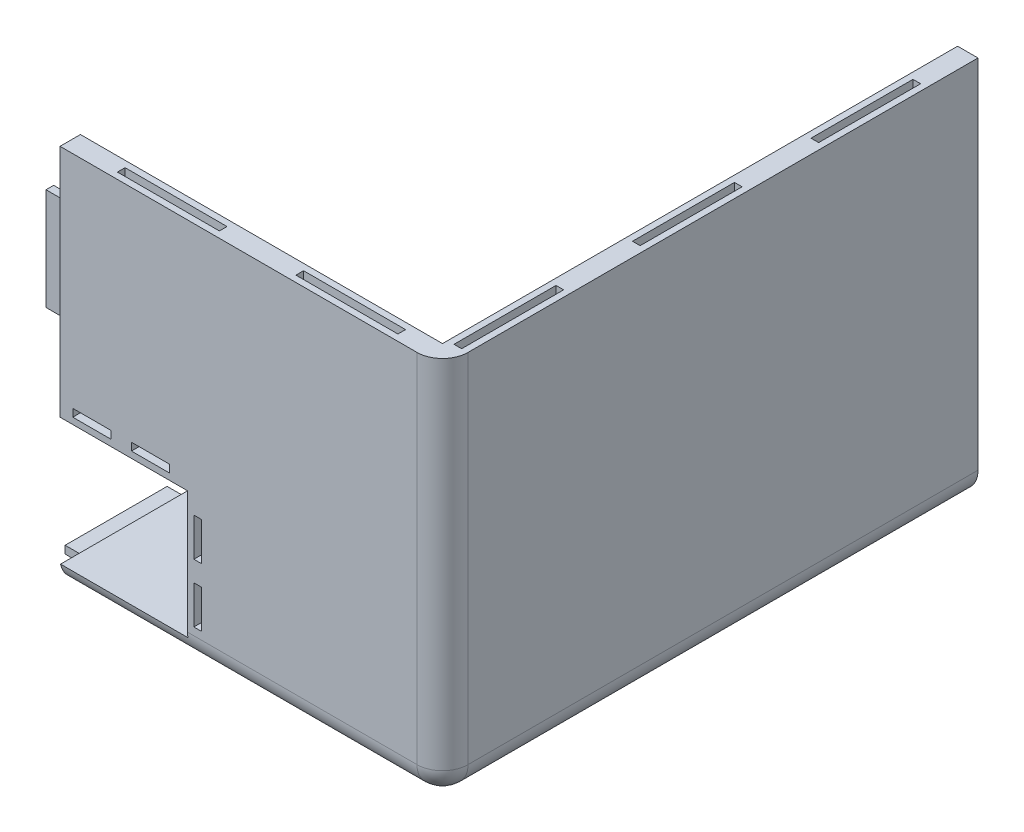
ISO-10303-21;
HEADER;
FILE_DESCRIPTION(('STEP AP214'),'2;1');
FILE_NAME('part.step','',(''),(''),'','','');
FILE_SCHEMA(('AUTOMOTIVE_DESIGN { 1 0 10303 214 1 1 1 1 }'));
ENDSEC;
DATA;
#1=APPLICATION_CONTEXT('core data for automotive mechanical design processes');
#2=APPLICATION_PROTOCOL_DEFINITION('international standard','automotive_design',2000,#1);
#3=PRODUCT_CONTEXT('',#1,'mechanical');
#4=PRODUCT('Part','Part','',(#3));
#5=PRODUCT_RELATED_PRODUCT_CATEGORY('part','',(#4));
#6=PRODUCT_DEFINITION_FORMATION('','',#4);
#7=PRODUCT_DEFINITION_CONTEXT('part definition',#1,'design');
#8=PRODUCT_DEFINITION('design','',#6,#7);
#9=PRODUCT_DEFINITION_SHAPE('','',#8);
#10=(LENGTH_UNIT() NAMED_UNIT(*) SI_UNIT(.MILLI.,.METRE.));
#11=(NAMED_UNIT(*) PLANE_ANGLE_UNIT() SI_UNIT($,.RADIAN.));
#12=(NAMED_UNIT(*) SI_UNIT($,.STERADIAN.) SOLID_ANGLE_UNIT());
#13=UNCERTAINTY_MEASURE_WITH_UNIT(LENGTH_MEASURE(1.E-05),#10,'distance_accuracy_value','');
#14=(GEOMETRIC_REPRESENTATION_CONTEXT(3) GLOBAL_UNCERTAINTY_ASSIGNED_CONTEXT((#13)) GLOBAL_UNIT_ASSIGNED_CONTEXT((#10,
#11,#12)) REPRESENTATION_CONTEXT('',''));
#15=CARTESIAN_POINT('',(0.,0.,0.));
#16=DIRECTION('',(0.,0.,1.));
#17=DIRECTION('',(1.,0.,0.));
#18=AXIS2_PLACEMENT_3D('',#15,#16,#17);
#19=CARTESIAN_POINT('',(0.,150.,0.));
#20=DIRECTION('',(1.,0.,0.));
#21=DIRECTION('',(0.,0.,-1.));
#22=AXIS2_PLACEMENT_3D('',#19,#20,#21);
#23=PLANE('',#22);
#24=DIRECTION('',(0.,-1.,0.));
#25=VECTOR('',#24,1.);
#26=CARTESIAN_POINT('',(0.,130.,-5.5));
#27=LINE('',#26,#25);
#28=CARTESIAN_POINT('',(0.,130.,-5.5));
#29=VERTEX_POINT('',#28);
#30=CARTESIAN_POINT('',(0.,90.,-5.5));
#31=VERTEX_POINT('',#30);
#32=EDGE_CURVE('E1091',#29,#31,#27,.T.);
#33=ORIENTED_EDGE('',*,*,#32,.F.);
#34=DIRECTION('',(0.,0.,-1.));
#35=VECTOR('',#34,1.);
#36=CARTESIAN_POINT('',(0.,130.,-5.5));
#37=LINE('',#36,#35);
#38=CARTESIAN_POINT('',(0.,130.,-2.5));
#39=VERTEX_POINT('',#38);
#40=EDGE_CURVE('E1078',#39,#29,#37,.T.);
#41=ORIENTED_EDGE('',*,*,#40,.F.);
#42=DIRECTION('',(0.,1.,0.));
#43=VECTOR('',#42,1.);
#44=CARTESIAN_POINT('',(0.,130.,-2.5));
#45=LINE('',#44,#43);
#46=CARTESIAN_POINT('',(0.,90.,-2.5));
#47=VERTEX_POINT('',#46);
#48=EDGE_CURVE('E1082',#47,#39,#45,.T.);
#49=ORIENTED_EDGE('',*,*,#48,.F.);
#50=DIRECTION('',(0.,0.,1.));
#51=VECTOR('',#50,1.);
#52=CARTESIAN_POINT('',(0.,90.,-5.5));
#53=LINE('',#52,#51);
#54=EDGE_CURVE('E1087',#31,#47,#53,.T.);
#55=ORIENTED_EDGE('',*,*,#54,.F.);
#56=EDGE_LOOP('',(#33,#41,#49,#55));
#57=FACE_BOUND('',#56,.T.);
#58=DIRECTION('',(0.,1.,0.));
#59=VECTOR('',#58,1.);
#60=CARTESIAN_POINT('',(0.,8.00000000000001,-8.00000000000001));
#61=LINE('',#60,#59);
#62=CARTESIAN_POINT('',(0.,58.,-8.00000000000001));
#63=VERTEX_POINT('',#62);
#64=CARTESIAN_POINT('',(0.,150.,-8.));
#65=VERTEX_POINT('',#64);
#66=EDGE_CURVE('E1170',#63,#65,#61,.T.);
#67=ORIENTED_EDGE('',*,*,#66,.F.);
#68=DIRECTION('',(0.,0.,1.));
#69=VECTOR('',#68,1.);
#70=CARTESIAN_POINT('',(0.,58.,-10.));
#71=LINE('',#70,#69);
#72=CARTESIAN_POINT('',(0.,58.,0.));
#73=VERTEX_POINT('',#72);
#74=EDGE_CURVE('E676',#63,#73,#71,.T.);
#75=ORIENTED_EDGE('',*,*,#74,.T.);
#76=DIRECTION('',(0.,-1.,0.));
#77=VECTOR('',#76,1.);
#78=CARTESIAN_POINT('',(0.,150.,0.));
#79=LINE('',#78,#77);
#80=CARTESIAN_POINT('',(0.,150.,0.));
#81=VERTEX_POINT('',#80);
#82=EDGE_CURVE('E1210',#81,#73,#79,.T.);
#83=ORIENTED_EDGE('',*,*,#82,.F.);
#84=DIRECTION('',(0.,0.,1.));
#85=VECTOR('',#84,1.);
#86=CARTESIAN_POINT('',(0.,150.,0.));
#87=LINE('',#86,#85);
#88=EDGE_CURVE('E1186',#65,#81,#87,.T.);
#89=ORIENTED_EDGE('',*,*,#88,.F.);
#90=EDGE_LOOP('',(#67,#75,#83,#89));
#91=FACE_BOUND('',#90,.T.);
#92=ADVANCED_FACE('F47',(#57,#91),#23,.F.);
#93=DIRECTION('',(0.,-1.,0.));
#94=VECTOR('',#93,1.);
#95=CARTESIAN_POINT('',(0.,5.5,-50.));
#96=LINE('',#95,#94);
#97=CARTESIAN_POINT('',(0.,5.5,-50.));
#98=VERTEX_POINT('',#97);
#99=CARTESIAN_POINT('',(0.,2.5,-50.));
#100=VERTEX_POINT('',#99);
#101=EDGE_CURVE('E1136',#98,#100,#96,.T.);
#102=ORIENTED_EDGE('',*,*,#101,.F.);
#103=DIRECTION('',(0.,0.,-1.));
#104=VECTOR('',#103,1.);
#105=CARTESIAN_POINT('',(0.,5.5,-50.));
#106=LINE('',#105,#104);
#107=CARTESIAN_POINT('',(0.,5.50000000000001,-9.99999999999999));
#108=VERTEX_POINT('',#107);
#109=EDGE_CURVE('E1123',#108,#98,#106,.T.);
#110=ORIENTED_EDGE('',*,*,#109,.F.);
#111=DIRECTION('',(0.,1.,0.));
#112=VECTOR('',#111,1.);
#113=CARTESIAN_POINT('',(0.,5.5,-9.99999999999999));
#114=LINE('',#113,#112);
#115=CARTESIAN_POINT('',(0.,2.5,-9.99999999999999));
#116=VERTEX_POINT('',#115);
#117=EDGE_CURVE('E1127',#116,#108,#114,.T.);
#118=ORIENTED_EDGE('',*,*,#117,.F.);
#119=DIRECTION('',(0.,0.,1.));
#120=VECTOR('',#119,1.);
#121=CARTESIAN_POINT('',(0.,2.5,-50.));
#122=LINE('',#121,#120);
#123=EDGE_CURVE('E1132',#100,#116,#122,.T.);
#124=ORIENTED_EDGE('',*,*,#123,.F.);
#125=EDGE_LOOP('',(#102,#110,#118,#124));
#126=FACE_BOUND('',#125,.T.);
#127=CARTESIAN_POINT('',(0.,10.,-10.));
#128=DIRECTION('',(1.,0.,0.));
#129=DIRECTION('',(0.,0.,-1.));
#130=AXIS2_PLACEMENT_3D('',#127,#128,#129);
#131=CIRCLE('',#130,10.);
#132=CARTESIAN_POINT('',(0.,0.,-10.));
#133=VERTEX_POINT('',#132);
#134=CARTESIAN_POINT('',(0.,8.,-0.202041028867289));
#135=VERTEX_POINT('',#134);
#136=EDGE_CURVE('E1237',#133,#135,#131,.F.);
#137=ORIENTED_EDGE('',*,*,#136,.T.);
#138=DIRECTION('',(0.,0.,1.));
#139=VECTOR('',#138,1.);
#140=CARTESIAN_POINT('',(0.,8.00000000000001,-210.));
#141=LINE('',#140,#139);
#142=CARTESIAN_POINT('',(0.,8.00000000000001,-80.));
#143=VERTEX_POINT('',#142);
#144=EDGE_CURVE('E1155',#143,#135,#141,.T.);
#145=ORIENTED_EDGE('',*,*,#144,.F.);
#146=DIRECTION('',(0.,1.,0.));
#147=VECTOR('',#146,1.);
#148=CARTESIAN_POINT('',(0.,2.5,-80.));
#149=LINE('',#148,#147);
#150=CARTESIAN_POINT('',(0.,0.,-80.));
#151=VERTEX_POINT('',#150);
#152=EDGE_CURVE('E1140',#151,#143,#149,.T.);
#153=ORIENTED_EDGE('',*,*,#152,.F.);
#154=DIRECTION('',(0.,0.,1.));
#155=VECTOR('',#154,1.);
#156=CARTESIAN_POINT('',(0.,0.,0.));
#157=LINE('',#156,#155);
#158=EDGE_CURVE('E1180',#151,#133,#157,.T.);
#159=ORIENTED_EDGE('',*,*,#158,.T.);
#160=EDGE_LOOP('',(#137,#145,#153,#159));
#161=FACE_BOUND('',#160,.T.);
#162=ADVANCED_FACE('F1306',(#126,#161),#23,.F.);
#163=CARTESIAN_POINT('',(0.,150.,0.));
#164=DIRECTION('',(0.,0.,-1.));
#165=DIRECTION('',(-1.,0.,0.));
#166=AXIS2_PLACEMENT_3D('',#163,#164,#165);
#167=PLANE('',#166);
#168=DIRECTION('',(1.,0.,0.));
#169=VECTOR('',#168,1.);
#170=CARTESIAN_POINT('',(5.,60.5,0.));
#171=LINE('',#170,#169);
#172=CARTESIAN_POINT('',(5.,60.5,0.));
#173=VERTEX_POINT('',#172);
#174=CARTESIAN_POINT('',(20.,60.5,0.));
#175=VERTEX_POINT('',#174);
#176=EDGE_CURVE('E524',#173,#175,#171,.T.);
#177=ORIENTED_EDGE('',*,*,#176,.F.);
#178=DIRECTION('',(0.,-1.,0.));
#179=VECTOR('',#178,1.);
#180=CARTESIAN_POINT('',(5.,63.5,0.));
#181=LINE('',#180,#179);
#182=CARTESIAN_POINT('',(5.,63.5,0.));
#183=VERTEX_POINT('',#182);
#184=EDGE_CURVE('E63',#183,#173,#181,.T.);
#185=ORIENTED_EDGE('',*,*,#184,.F.);
#186=DIRECTION('',(-1.,0.,0.));
#187=VECTOR('',#186,1.);
#188=CARTESIAN_POINT('',(5.,63.5,0.));
#189=LINE('',#188,#187);
#190=CARTESIAN_POINT('',(20.,63.5,0.));
#191=VERTEX_POINT('',#190);
#192=EDGE_CURVE('E511',#191,#183,#189,.T.);
#193=ORIENTED_EDGE('',*,*,#192,.F.);
#194=DIRECTION('',(0.,1.,0.));
#195=VECTOR('',#194,1.);
#196=CARTESIAN_POINT('',(20.,63.5,0.));
#197=LINE('',#196,#195);
#198=EDGE_CURVE('E515',#175,#191,#197,.T.);
#199=ORIENTED_EDGE('',*,*,#198,.F.);
#200=EDGE_LOOP('',(#177,#185,#193,#199));
#201=FACE_BOUND('',#200,.T.);
#202=DIRECTION('',(1.,0.,0.));
#203=VECTOR('',#202,1.);
#204=CARTESIAN_POINT('',(28.,60.5,0.));
#205=LINE('',#204,#203);
#206=CARTESIAN_POINT('',(28.,60.5,0.));
#207=VERTEX_POINT('',#206);
#208=CARTESIAN_POINT('',(43.,60.5,0.));
#209=VERTEX_POINT('',#208);
#210=EDGE_CURVE('E562',#207,#209,#205,.T.);
#211=ORIENTED_EDGE('',*,*,#210,.F.);
#212=DIRECTION('',(0.,-1.,0.));
#213=VECTOR('',#212,1.);
#214=CARTESIAN_POINT('',(28.,63.5,0.));
#215=LINE('',#214,#213);
#216=CARTESIAN_POINT('',(28.,63.5,0.));
#217=VERTEX_POINT('',#216);
#218=EDGE_CURVE('E71',#217,#207,#215,.T.);
#219=ORIENTED_EDGE('',*,*,#218,.F.);
#220=DIRECTION('',(-1.,0.,0.));
#221=VECTOR('',#220,1.);
#222=CARTESIAN_POINT('',(28.,63.5,0.));
#223=LINE('',#222,#221);
#224=CARTESIAN_POINT('',(43.,63.5,0.));
#225=VERTEX_POINT('',#224);
#226=EDGE_CURVE('E553',#225,#217,#223,.T.);
#227=ORIENTED_EDGE('',*,*,#226,.F.);
#228=DIRECTION('',(0.,1.,0.));
#229=VECTOR('',#228,1.);
#230=CARTESIAN_POINT('',(43.,63.5,0.));
#231=LINE('',#230,#229);
#232=EDGE_CURVE('E557',#209,#225,#231,.T.);
#233=ORIENTED_EDGE('',*,*,#232,.F.);
#234=EDGE_LOOP('',(#211,#219,#227,#233));
#235=FACE_BOUND('',#234,.T.);
#236=DIRECTION('',(1.,0.,0.));
#237=VECTOR('',#236,1.);
#238=CARTESIAN_POINT('',(52.5,36.,0.));
#239=LINE('',#238,#237);
#240=CARTESIAN_POINT('',(52.5,36.,0.));
#241=VERTEX_POINT('',#240);
#242=CARTESIAN_POINT('',(55.5,36.,0.));
#243=VERTEX_POINT('',#242);
#244=EDGE_CURVE('E606',#241,#243,#239,.T.);
#245=ORIENTED_EDGE('',*,*,#244,.F.);
#246=DIRECTION('',(0.,-1.,0.));
#247=VECTOR('',#246,1.);
#248=CARTESIAN_POINT('',(52.5,51.,0.));
#249=LINE('',#248,#247);
#250=CARTESIAN_POINT('',(52.5,51.,0.));
#251=VERTEX_POINT('',#250);
#252=EDGE_CURVE('E552',#251,#241,#249,.T.);
#253=ORIENTED_EDGE('',*,*,#252,.F.);
#254=DIRECTION('',(-1.,0.,0.));
#255=VECTOR('',#254,1.);
#256=CARTESIAN_POINT('',(52.5,51.,0.));
#257=LINE('',#256,#255);
#258=CARTESIAN_POINT('',(55.5,51.,0.));
#259=VERTEX_POINT('',#258);
#260=EDGE_CURVE('E597',#259,#251,#257,.T.);
#261=ORIENTED_EDGE('',*,*,#260,.F.);
#262=DIRECTION('',(0.,1.,0.));
#263=VECTOR('',#262,1.);
#264=CARTESIAN_POINT('',(55.5,51.,0.));
#265=LINE('',#264,#263);
#266=EDGE_CURVE('E601',#243,#259,#265,.T.);
#267=ORIENTED_EDGE('',*,*,#266,.F.);
#268=EDGE_LOOP('',(#245,#253,#261,#267));
#269=FACE_BOUND('',#268,.T.);
#270=DIRECTION('',(1.,0.,0.));
#271=VECTOR('',#270,1.);
#272=CARTESIAN_POINT('',(52.5,13.,0.));
#273=LINE('',#272,#271);
#274=CARTESIAN_POINT('',(52.5,13.,0.));
#275=VERTEX_POINT('',#274);
#276=CARTESIAN_POINT('',(55.5,13.,0.));
#277=VERTEX_POINT('',#276);
#278=EDGE_CURVE('E649',#275,#277,#273,.T.);
#279=ORIENTED_EDGE('',*,*,#278,.F.);
#280=DIRECTION('',(0.,-1.,0.));
#281=VECTOR('',#280,1.);
#282=CARTESIAN_POINT('',(52.5,28.,0.));
#283=LINE('',#282,#281);
#284=CARTESIAN_POINT('',(52.5,28.,0.));
#285=VERTEX_POINT('',#284);
#286=EDGE_CURVE('E596',#285,#275,#283,.T.);
#287=ORIENTED_EDGE('',*,*,#286,.F.);
#288=DIRECTION('',(-1.,0.,0.));
#289=VECTOR('',#288,1.);
#290=CARTESIAN_POINT('',(52.5,28.,0.));
#291=LINE('',#290,#289);
#292=CARTESIAN_POINT('',(55.5,28.,0.));
#293=VERTEX_POINT('',#292);
#294=EDGE_CURVE('E640',#293,#285,#291,.T.);
#295=ORIENTED_EDGE('',*,*,#294,.F.);
#296=DIRECTION('',(0.,1.,0.));
#297=VECTOR('',#296,1.);
#298=CARTESIAN_POINT('',(55.5,28.,0.));
#299=LINE('',#298,#297);
#300=EDGE_CURVE('E644',#277,#293,#299,.T.);
#301=ORIENTED_EDGE('',*,*,#300,.F.);
#302=EDGE_LOOP('',(#279,#287,#295,#301));
#303=FACE_BOUND('',#302,.T.);
#304=ORIENTED_EDGE('',*,*,#82,.T.);
#305=DIRECTION('',(-1.,0.,0.));
#306=VECTOR('',#305,1.);
#307=CARTESIAN_POINT('',(0.,58.,0.));
#308=LINE('',#307,#306);
#309=CARTESIAN_POINT('',(50.,58.,0.));
#310=VERTEX_POINT('',#309);
#311=EDGE_CURVE('E672',#310,#73,#308,.T.);
#312=ORIENTED_EDGE('',*,*,#311,.F.);
#313=DIRECTION('',(0.,1.,0.));
#314=VECTOR('',#313,1.);
#315=CARTESIAN_POINT('',(50.,58.,0.));
#316=LINE('',#315,#314);
#317=CARTESIAN_POINT('',(50.,10.,0.));
#318=VERTEX_POINT('',#317);
#319=EDGE_CURVE('E533',#318,#310,#316,.T.);
#320=ORIENTED_EDGE('',*,*,#319,.F.);
#321=DIRECTION('',(1.,0.,0.));
#322=VECTOR('',#321,1.);
#323=CARTESIAN_POINT('',(150.,10.,0.));
#324=LINE('',#323,#322);
#325=CARTESIAN_POINT('',(140.,10.,0.));
#326=VERTEX_POINT('',#325);
#327=EDGE_CURVE('E1234',#318,#326,#324,.T.);
#328=ORIENTED_EDGE('',*,*,#327,.T.);
#329=DIRECTION('',(0.,-1.,0.));
#330=VECTOR('',#329,1.);
#331=CARTESIAN_POINT('',(140.,150.,0.));
#332=LINE('',#331,#330);
#333=CARTESIAN_POINT('',(140.,150.,0.));
#334=VERTEX_POINT('',#333);
#335=EDGE_CURVE('E1231',#326,#334,#332,.F.);
#336=ORIENTED_EDGE('',*,*,#335,.T.);
#337=DIRECTION('',(1.,0.,0.));
#338=VECTOR('',#337,1.);
#339=CARTESIAN_POINT('',(0.,150.,0.));
#340=LINE('',#339,#338);
#341=EDGE_CURVE('E1189',#81,#334,#340,.T.);
#342=ORIENTED_EDGE('',*,*,#341,.F.);
#343=EDGE_LOOP('',(#304,#312,#320,#328,#336,#342));
#344=FACE_BOUND('',#343,.T.);
#345=ADVANCED_FACE('F1271',(#201,#235,#269,#303,#344),#167,.F.);
#346=CARTESIAN_POINT('',(150.,150.,0.));
#347=DIRECTION('',(-1.,0.,0.));
#348=DIRECTION('',(0.,0.,1.));
#349=AXIS2_PLACEMENT_3D('',#346,#347,#348);
#350=PLANE('',#349);
#351=DIRECTION('',(0.,-1.,0.));
#352=VECTOR('',#351,1.);
#353=CARTESIAN_POINT('',(150.,150.,-10.));
#354=LINE('',#353,#352);
#355=CARTESIAN_POINT('',(150.,150.,-10.));
#356=VERTEX_POINT('',#355);
#357=CARTESIAN_POINT('',(150.,10.,-10.));
#358=VERTEX_POINT('',#357);
#359=EDGE_CURVE('E1214',#356,#358,#354,.T.);
#360=ORIENTED_EDGE('',*,*,#359,.T.);
#361=DIRECTION('',(0.,0.,-1.));
#362=VECTOR('',#361,1.);
#363=CARTESIAN_POINT('',(150.,10.,-210.));
#364=LINE('',#363,#362);
#365=CARTESIAN_POINT('',(150.,10.,-210.));
#366=VERTEX_POINT('',#365);
#367=EDGE_CURVE('E1217',#358,#366,#364,.T.);
#368=ORIENTED_EDGE('',*,*,#367,.T.);
#369=DIRECTION('',(0.,-1.,0.));
#370=VECTOR('',#369,1.);
#371=CARTESIAN_POINT('',(150.,150.,-210.));
#372=LINE('',#371,#370);
#373=CARTESIAN_POINT('',(150.,150.,-210.));
#374=VERTEX_POINT('',#373);
#375=EDGE_CURVE('E1201',#374,#366,#372,.T.);
#376=ORIENTED_EDGE('',*,*,#375,.F.);
#377=DIRECTION('',(0.,0.,-1.));
#378=VECTOR('',#377,1.);
#379=CARTESIAN_POINT('',(150.,150.,0.));
#380=LINE('',#379,#378);
#381=EDGE_CURVE('E1194',#356,#374,#380,.T.);
#382=ORIENTED_EDGE('',*,*,#381,.F.);
#383=EDGE_LOOP('',(#360,#368,#376,#382));
#384=FACE_BOUND('',#383,.T.);
#385=ADVANCED_FACE('F1318',(#384),#350,.F.);
#386=CARTESIAN_POINT('',(0.,150.,-210.));
#387=DIRECTION('',(0.,0.,1.));
#388=DIRECTION('',(1.,0.,0.));
#389=AXIS2_PLACEMENT_3D('',#386,#387,#388);
#390=PLANE('',#389);
#391=DIRECTION('',(-1.,0.,0.));
#392=VECTOR('',#391,1.);
#393=CARTESIAN_POINT('',(147.5,90.,-210.));
#394=LINE('',#393,#392);
#395=CARTESIAN_POINT('',(147.5,90.,-210.));
#396=VERTEX_POINT('',#395);
#397=CARTESIAN_POINT('',(144.5,90.,-210.));
#398=VERTEX_POINT('',#397);
#399=EDGE_CURVE('E949',#396,#398,#394,.T.);
#400=ORIENTED_EDGE('',*,*,#399,.F.);
#401=DIRECTION('',(0.,-1.,0.));
#402=VECTOR('',#401,1.);
#403=CARTESIAN_POINT('',(147.5,130.,-210.));
#404=LINE('',#403,#402);
#405=CARTESIAN_POINT('',(147.5,130.,-210.));
#406=VERTEX_POINT('',#405);
#407=EDGE_CURVE('E946',#406,#396,#404,.T.);
#408=ORIENTED_EDGE('',*,*,#407,.F.);
#409=DIRECTION('',(1.,0.,0.));
#410=VECTOR('',#409,1.);
#411=CARTESIAN_POINT('',(147.5,130.,-210.));
#412=LINE('',#411,#410);
#413=CARTESIAN_POINT('',(144.5,130.,-210.));
#414=VERTEX_POINT('',#413);
#415=EDGE_CURVE('E933',#414,#406,#412,.T.);
#416=ORIENTED_EDGE('',*,*,#415,.F.);
#417=DIRECTION('',(0.,1.,0.));
#418=VECTOR('',#417,1.);
#419=CARTESIAN_POINT('',(144.5,130.,-210.));
#420=LINE('',#419,#418);
#421=EDGE_CURVE('E954',#398,#414,#420,.T.);
#422=ORIENTED_EDGE('',*,*,#421,.F.);
#423=EDGE_LOOP('',(#400,#408,#416,#422));
#424=FACE_BOUND('',#423,.T.);
#425=DIRECTION('',(-1.,0.,0.));
#426=VECTOR('',#425,1.);
#427=CARTESIAN_POINT('',(147.5,20.,-210.));
#428=LINE('',#427,#426);
#429=CARTESIAN_POINT('',(147.5,20.,-210.));
#430=VERTEX_POINT('',#429);
#431=CARTESIAN_POINT('',(144.5,20.,-210.));
#432=VERTEX_POINT('',#431);
#433=EDGE_CURVE('E998',#430,#432,#428,.T.);
#434=ORIENTED_EDGE('',*,*,#433,.F.);
#435=DIRECTION('',(0.,-1.,0.));
#436=VECTOR('',#435,1.);
#437=CARTESIAN_POINT('',(147.5,60.,-210.));
#438=LINE('',#437,#436);
#439=CARTESIAN_POINT('',(147.5,60.,-210.));
#440=VERTEX_POINT('',#439);
#441=EDGE_CURVE('E950',#440,#430,#438,.T.);
#442=ORIENTED_EDGE('',*,*,#441,.F.);
#443=DIRECTION('',(1.,0.,0.));
#444=VECTOR('',#443,1.);
#445=CARTESIAN_POINT('',(147.5,60.,-210.));
#446=LINE('',#445,#444);
#447=CARTESIAN_POINT('',(144.5,60.,-210.));
#448=VERTEX_POINT('',#447);
#449=EDGE_CURVE('E989',#448,#440,#446,.T.);
#450=ORIENTED_EDGE('',*,*,#449,.F.);
#451=DIRECTION('',(0.,1.,0.));
#452=VECTOR('',#451,1.);
#453=CARTESIAN_POINT('',(144.5,60.,-210.));
#454=LINE('',#453,#452);
#455=EDGE_CURVE('E993',#432,#448,#454,.T.);
#456=ORIENTED_EDGE('',*,*,#455,.F.);
#457=EDGE_LOOP('',(#434,#442,#450,#456));
#458=FACE_BOUND('',#457,.T.);
#459=DIRECTION('',(-1.,0.,0.));
#460=VECTOR('',#459,1.);
#461=CARTESIAN_POINT('',(130.,2.5,-210.));
#462=LINE('',#461,#460);
#463=CARTESIAN_POINT('',(130.,2.5,-210.));
#464=VERTEX_POINT('',#463);
#465=CARTESIAN_POINT('',(90.,2.5,-210.));
#466=VERTEX_POINT('',#465);
#467=EDGE_CURVE('E1042',#464,#466,#462,.T.);
#468=ORIENTED_EDGE('',*,*,#467,.F.);
#469=DIRECTION('',(0.,-1.,0.));
#470=VECTOR('',#469,1.);
#471=CARTESIAN_POINT('',(130.,5.5,-210.));
#472=LINE('',#471,#470);
#473=CARTESIAN_POINT('',(130.,5.5,-210.));
#474=VERTEX_POINT('',#473);
#475=EDGE_CURVE('E988',#474,#464,#472,.T.);
#476=ORIENTED_EDGE('',*,*,#475,.F.);
#477=DIRECTION('',(1.,0.,0.));
#478=VECTOR('',#477,1.);
#479=CARTESIAN_POINT('',(130.,5.5,-210.));
#480=LINE('',#479,#478);
#481=CARTESIAN_POINT('',(90.,5.50000000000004,-210.));
#482=VERTEX_POINT('',#481);
#483=EDGE_CURVE('E1033',#482,#474,#480,.T.);
#484=ORIENTED_EDGE('',*,*,#483,.F.);
#485=DIRECTION('',(0.,1.,0.));
#486=VECTOR('',#485,1.);
#487=CARTESIAN_POINT('',(90.,5.50000000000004,-210.));
#488=LINE('',#487,#486);
#489=EDGE_CURVE('E1037',#466,#482,#488,.T.);
#490=ORIENTED_EDGE('',*,*,#489,.F.);
#491=EDGE_LOOP('',(#468,#476,#484,#490));
#492=FACE_BOUND('',#491,.T.);
#493=DIRECTION('',(-1.,0.,0.));
#494=VECTOR('',#493,1.);
#495=CARTESIAN_POINT('',(0.,0.,-210.));
#496=LINE('',#495,#494);
#497=CARTESIAN_POINT('',(140.,0.,-210.));
#498=VERTEX_POINT('',#497);
#499=CARTESIAN_POINT('',(80.,0.,-210.));
#500=VERTEX_POINT('',#499);
#501=EDGE_CURVE('E1190',#498,#500,#496,.T.);
#502=ORIENTED_EDGE('',*,*,#501,.T.);
#503=DIRECTION('',(0.,-1.,0.));
#504=VECTOR('',#503,1.);
#505=CARTESIAN_POINT('',(80.,10.,-210.));
#506=LINE('',#505,#504);
#507=CARTESIAN_POINT('',(80.,8.00000000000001,-210.));
#508=VERTEX_POINT('',#507);
#509=EDGE_CURVE('E699',#508,#500,#506,.T.);
#510=ORIENTED_EDGE('',*,*,#509,.F.);
#511=DIRECTION('',(-1.,0.,0.));
#512=VECTOR('',#511,1.);
#513=CARTESIAN_POINT('',(0.,8.00000000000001,-210.));
#514=LINE('',#513,#512);
#515=CARTESIAN_POINT('',(142.,8.00000000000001,-210.));
#516=VERTEX_POINT('',#515);
#517=EDGE_CURVE('E1166',#516,#508,#514,.T.);
#518=ORIENTED_EDGE('',*,*,#517,.F.);
#519=DIRECTION('',(0.,1.,0.));
#520=VECTOR('',#519,1.);
#521=CARTESIAN_POINT('',(142.,8.00000000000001,-210.));
#522=LINE('',#521,#520);
#523=CARTESIAN_POINT('',(142.,150.,-210.));
#524=VERTEX_POINT('',#523);
#525=EDGE_CURVE('E1176',#516,#524,#522,.T.);
#526=ORIENTED_EDGE('',*,*,#525,.T.);
#527=DIRECTION('',(-1.,0.,0.));
#528=VECTOR('',#527,1.);
#529=CARTESIAN_POINT('',(0.,150.,-210.));
#530=LINE('',#529,#528);
#531=EDGE_CURVE('E1197',#374,#524,#530,.T.);
#532=ORIENTED_EDGE('',*,*,#531,.F.);
#533=ORIENTED_EDGE('',*,*,#375,.T.);
#534=CARTESIAN_POINT('',(140.,10.,-210.));
#535=DIRECTION('',(0.,0.,1.));
#536=DIRECTION('',(1.,0.,0.));
#537=AXIS2_PLACEMENT_3D('',#534,#535,#536);
#538=CIRCLE('',#537,10.);
#539=EDGE_CURVE('E1221',#366,#498,#538,.F.);
#540=ORIENTED_EDGE('',*,*,#539,.T.);
#541=EDGE_LOOP('',(#502,#510,#518,#526,#532,#533,#540));
#542=FACE_BOUND('',#541,.T.);
#543=ADVANCED_FACE('F1321',(#424,#458,#492,#542),#390,.F.);
#544=CARTESIAN_POINT('',(0.,150.,0.));
#545=DIRECTION('',(0.,-1.,0.));
#546=DIRECTION('',(0.,0.,-1.));
#547=AXIS2_PLACEMENT_3D('',#544,#545,#546);
#548=PLANE('',#547);
#549=DIRECTION('',(1.,0.,0.));
#550=VECTOR('',#549,1.);
#551=CARTESIAN_POINT('',(20.,150.,-2.5));
#552=LINE('',#551,#550);
#553=CARTESIAN_POINT('',(20.,150.,-2.5));
#554=VERTEX_POINT('',#553);
#555=CARTESIAN_POINT('',(60.,150.,-2.5));
#556=VERTEX_POINT('',#555);
#557=EDGE_CURVE('E729',#554,#556,#552,.T.);
#558=ORIENTED_EDGE('',*,*,#557,.F.);
#559=DIRECTION('',(0.,0.,1.));
#560=VECTOR('',#559,1.);
#561=CARTESIAN_POINT('',(20.,150.,-5.5));
#562=LINE('',#561,#560);
#563=CARTESIAN_POINT('',(20.,150.,-5.5));
#564=VERTEX_POINT('',#563);
#565=EDGE_CURVE('E726',#564,#554,#562,.T.);
#566=ORIENTED_EDGE('',*,*,#565,.F.);
#567=DIRECTION('',(-1.,0.,0.));
#568=VECTOR('',#567,1.);
#569=CARTESIAN_POINT('',(20.,150.,-5.5));
#570=LINE('',#569,#568);
#571=CARTESIAN_POINT('',(60.,150.,-5.50000000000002));
#572=VERTEX_POINT('',#571);
#573=EDGE_CURVE('E713',#572,#564,#570,.T.);
#574=ORIENTED_EDGE('',*,*,#573,.F.);
#575=DIRECTION('',(0.,0.,-1.));
#576=VECTOR('',#575,1.);
#577=CARTESIAN_POINT('',(60.,150.,-5.50000000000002));
#578=LINE('',#577,#576);
#579=EDGE_CURVE('E734',#556,#572,#578,.T.);
#580=ORIENTED_EDGE('',*,*,#579,.F.);
#581=EDGE_LOOP('',(#558,#566,#574,#580));
#582=FACE_BOUND('',#581,.T.);
#583=DIRECTION('',(-1.,0.,0.));
#584=VECTOR('',#583,1.);
#585=CARTESIAN_POINT('',(147.5,150.,-50.));
#586=LINE('',#585,#584);
#587=CARTESIAN_POINT('',(147.5,150.,-50.));
#588=VERTEX_POINT('',#587);
#589=CARTESIAN_POINT('',(144.5,150.,-50.));
#590=VERTEX_POINT('',#589);
#591=EDGE_CURVE('E822',#588,#590,#586,.T.);
#592=ORIENTED_EDGE('',*,*,#591,.F.);
#593=DIRECTION('',(0.,0.,-1.));
#594=VECTOR('',#593,1.);
#595=CARTESIAN_POINT('',(147.5,150.,-50.));
#596=LINE('',#595,#594);
#597=CARTESIAN_POINT('',(147.5,150.,-9.99999999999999));
#598=VERTEX_POINT('',#597);
#599=EDGE_CURVE('E768',#598,#588,#596,.T.);
#600=ORIENTED_EDGE('',*,*,#599,.F.);
#601=DIRECTION('',(1.,0.,0.));
#602=VECTOR('',#601,1.);
#603=CARTESIAN_POINT('',(147.5,150.,-9.99999999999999));
#604=LINE('',#603,#602);
#605=CARTESIAN_POINT('',(144.5,150.,-9.99999999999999));
#606=VERTEX_POINT('',#605);
#607=EDGE_CURVE('E813',#606,#598,#604,.T.);
#608=ORIENTED_EDGE('',*,*,#607,.F.);
#609=DIRECTION('',(0.,0.,1.));
#610=VECTOR('',#609,1.);
#611=CARTESIAN_POINT('',(144.5,150.,-50.));
#612=LINE('',#611,#610);
#613=EDGE_CURVE('E817',#590,#606,#612,.T.);
#614=ORIENTED_EDGE('',*,*,#613,.F.);
#615=EDGE_LOOP('',(#592,#600,#608,#614));
#616=FACE_BOUND('',#615,.T.);
#617=DIRECTION('',(-1.,0.,0.));
#618=VECTOR('',#617,1.);
#619=CARTESIAN_POINT('',(147.5,150.,-120.));
#620=LINE('',#619,#618);
#621=CARTESIAN_POINT('',(147.5,150.,-120.));
#622=VERTEX_POINT('',#621);
#623=CARTESIAN_POINT('',(144.5,150.,-120.));
#624=VERTEX_POINT('',#623);
#625=EDGE_CURVE('E778',#622,#624,#620,.T.);
#626=ORIENTED_EDGE('',*,*,#625,.F.);
#627=DIRECTION('',(0.,0.,-1.));
#628=VECTOR('',#627,1.);
#629=CARTESIAN_POINT('',(147.5,150.,-120.));
#630=LINE('',#629,#628);
#631=CARTESIAN_POINT('',(147.5,150.,-80.));
#632=VERTEX_POINT('',#631);
#633=EDGE_CURVE('E782',#632,#622,#630,.T.);
#634=ORIENTED_EDGE('',*,*,#633,.F.);
#635=DIRECTION('',(1.,0.,0.));
#636=VECTOR('',#635,1.);
#637=CARTESIAN_POINT('',(147.5,150.,-80.));
#638=LINE('',#637,#636);
#639=CARTESIAN_POINT('',(144.5,150.,-80.));
#640=VERTEX_POINT('',#639);
#641=EDGE_CURVE('E769',#640,#632,#638,.T.);
#642=ORIENTED_EDGE('',*,*,#641,.F.);
#643=DIRECTION('',(0.,0.,1.));
#644=VECTOR('',#643,1.);
#645=CARTESIAN_POINT('',(144.5,150.,-120.));
#646=LINE('',#645,#644);
#647=EDGE_CURVE('E773',#624,#640,#646,.T.);
#648=ORIENTED_EDGE('',*,*,#647,.F.);
#649=EDGE_LOOP('',(#626,#634,#642,#648));
#650=FACE_BOUND('',#649,.T.);
#651=DIRECTION('',(1.,0.,0.));
#652=VECTOR('',#651,1.);
#653=CARTESIAN_POINT('',(144.5,150.,-150.));
#654=LINE('',#653,#652);
#655=CARTESIAN_POINT('',(144.5,150.,-150.));
#656=VERTEX_POINT('',#655);
#657=CARTESIAN_POINT('',(147.5,150.,-150.));
#658=VERTEX_POINT('',#657);
#659=EDGE_CURVE('E908',#656,#658,#654,.T.);
#660=ORIENTED_EDGE('',*,*,#659,.F.);
#661=DIRECTION('',(0.,0.,1.));
#662=VECTOR('',#661,1.);
#663=CARTESIAN_POINT('',(144.5,150.,-190.));
#664=LINE('',#663,#662);
#665=CARTESIAN_POINT('',(144.5,150.,-190.));
#666=VERTEX_POINT('',#665);
#667=EDGE_CURVE('E856',#666,#656,#664,.T.);
#668=ORIENTED_EDGE('',*,*,#667,.F.);
#669=DIRECTION('',(-1.,0.,0.));
#670=VECTOR('',#669,1.);
#671=CARTESIAN_POINT('',(144.5,150.,-190.));
#672=LINE('',#671,#670);
#673=CARTESIAN_POINT('',(147.5,150.,-190.));
#674=VERTEX_POINT('',#673);
#675=EDGE_CURVE('E899',#674,#666,#672,.T.);
#676=ORIENTED_EDGE('',*,*,#675,.F.);
#677=DIRECTION('',(0.,0.,-1.));
#678=VECTOR('',#677,1.);
#679=CARTESIAN_POINT('',(147.5,150.,-190.));
#680=LINE('',#679,#678);
#681=EDGE_CURVE('E903',#658,#674,#680,.T.);
#682=ORIENTED_EDGE('',*,*,#681,.F.);
#683=EDGE_LOOP('',(#660,#668,#676,#682));
#684=FACE_BOUND('',#683,.T.);
#685=DIRECTION('',(1.,0.,0.));
#686=VECTOR('',#685,1.);
#687=CARTESIAN_POINT('',(90.,150.,-2.50000000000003));
#688=LINE('',#687,#686);
#689=CARTESIAN_POINT('',(90.,150.,-2.50000000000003));
#690=VERTEX_POINT('',#689);
#691=CARTESIAN_POINT('',(130.,150.,-2.50000000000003));
#692=VERTEX_POINT('',#691);
#693=EDGE_CURVE('E866',#690,#692,#688,.T.);
#694=ORIENTED_EDGE('',*,*,#693,.F.);
#695=DIRECTION('',(0.,0.,1.));
#696=VECTOR('',#695,1.);
#697=CARTESIAN_POINT('',(90.,150.,-5.50000000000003));
#698=LINE('',#697,#696);
#699=CARTESIAN_POINT('',(90.,150.,-5.50000000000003));
#700=VERTEX_POINT('',#699);
#701=EDGE_CURVE('E730',#700,#690,#698,.T.);
#702=ORIENTED_EDGE('',*,*,#701,.F.);
#703=DIRECTION('',(-1.,0.,0.));
#704=VECTOR('',#703,1.);
#705=CARTESIAN_POINT('',(90.,150.,-5.50000000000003));
#706=LINE('',#705,#704);
#707=CARTESIAN_POINT('',(130.,150.,-5.50000000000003));
#708=VERTEX_POINT('',#707);
#709=EDGE_CURVE('E857',#708,#700,#706,.T.);
#710=ORIENTED_EDGE('',*,*,#709,.F.);
#711=DIRECTION('',(0.,0.,-1.));
#712=VECTOR('',#711,1.);
#713=CARTESIAN_POINT('',(130.,150.,-5.50000000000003));
#714=LINE('',#713,#712);
#715=EDGE_CURVE('E861',#692,#708,#714,.T.);
#716=ORIENTED_EDGE('',*,*,#715,.F.);
#717=EDGE_LOOP('',(#694,#702,#710,#716));
#718=FACE_BOUND('',#717,.T.);
#719=ORIENTED_EDGE('',*,*,#341,.T.);
#720=CARTESIAN_POINT('',(140.,150.,-10.));
#721=DIRECTION('',(0.,-1.,0.));
#722=DIRECTION('',(0.,0.,-1.));
#723=AXIS2_PLACEMENT_3D('',#720,#721,#722);
#724=CIRCLE('',#723,10.);
#725=EDGE_CURVE('E1241',#334,#356,#724,.F.);
#726=ORIENTED_EDGE('',*,*,#725,.T.);
#727=ORIENTED_EDGE('',*,*,#381,.T.);
#728=ORIENTED_EDGE('',*,*,#531,.T.);
#729=DIRECTION('',(0.,0.,-1.));
#730=VECTOR('',#729,1.);
#731=CARTESIAN_POINT('',(142.,150.,-210.));
#732=LINE('',#731,#730);
#733=CARTESIAN_POINT('',(142.,150.,-8.));
#734=VERTEX_POINT('',#733);
#735=EDGE_CURVE('E1159',#734,#524,#732,.T.);
#736=ORIENTED_EDGE('',*,*,#735,.F.);
#737=DIRECTION('',(1.,0.,0.));
#738=VECTOR('',#737,1.);
#739=CARTESIAN_POINT('',(0.,150.,-8.00000000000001));
#740=LINE('',#739,#738);
#741=EDGE_CURVE('E1154',#65,#734,#740,.T.);
#742=ORIENTED_EDGE('',*,*,#741,.F.);
#743=ORIENTED_EDGE('',*,*,#88,.T.);
#744=EDGE_LOOP('',(#719,#726,#727,#728,#736,#742,#743));
#745=FACE_BOUND('',#744,.T.);
#746=ADVANCED_FACE('F1288',(#582,#616,#650,#684,#718,#745),#548,.F.);
#747=CARTESIAN_POINT('',(0.,0.,0.));
#748=DIRECTION('',(0.,-1.,0.));
#749=DIRECTION('',(0.,0.,-1.));
#750=AXIS2_PLACEMENT_3D('',#747,#748,#749);
#751=PLANE('',#750);
#752=DIRECTION('',(0.,0.,1.));
#753=VECTOR('',#752,1.);
#754=CARTESIAN_POINT('',(80.,0.,-80.));
#755=LINE('',#754,#753);
#756=CARTESIAN_POINT('',(80.,0.,-80.));
#757=VERTEX_POINT('',#756);
#758=EDGE_CURVE('E690',#500,#757,#755,.T.);
#759=ORIENTED_EDGE('',*,*,#758,.F.);
#760=ORIENTED_EDGE('',*,*,#501,.F.);
#761=DIRECTION('',(0.,0.,-1.));
#762=VECTOR('',#761,1.);
#763=CARTESIAN_POINT('',(140.,0.,0.));
#764=LINE('',#763,#762);
#765=CARTESIAN_POINT('',(140.,0.,-10.));
#766=VERTEX_POINT('',#765);
#767=EDGE_CURVE('E1228',#498,#766,#764,.F.);
#768=ORIENTED_EDGE('',*,*,#767,.T.);
#769=DIRECTION('',(1.,0.,0.));
#770=VECTOR('',#769,1.);
#771=CARTESIAN_POINT('',(0.,0.,-10.));
#772=LINE('',#771,#770);
#773=EDGE_CURVE('E1224',#766,#133,#772,.F.);
#774=ORIENTED_EDGE('',*,*,#773,.T.);
#775=ORIENTED_EDGE('',*,*,#158,.F.);
#776=DIRECTION('',(-1.,0.,0.));
#777=VECTOR('',#776,1.);
#778=CARTESIAN_POINT('',(80.,0.,-80.));
#779=LINE('',#778,#777);
#780=EDGE_CURVE('E694',#757,#151,#779,.T.);
#781=ORIENTED_EDGE('',*,*,#780,.F.);
#782=EDGE_LOOP('',(#759,#760,#768,#774,#775,#781));
#783=FACE_BOUND('',#782,.T.);
#784=ADVANCED_FACE('F1311',(#783),#751,.T.);
#785=CARTESIAN_POINT('',(142.,8.00000000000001,-210.));
#786=DIRECTION('',(1.,0.,0.));
#787=DIRECTION('',(0.,0.,-1.));
#788=AXIS2_PLACEMENT_3D('',#785,#786,#787);
#789=PLANE('',#788);
#790=ORIENTED_EDGE('',*,*,#735,.T.);
#791=ORIENTED_EDGE('',*,*,#525,.F.);
#792=DIRECTION('',(0.,0.,-1.));
#793=VECTOR('',#792,1.);
#794=CARTESIAN_POINT('',(142.,8.00000000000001,-210.));
#795=LINE('',#794,#793);
#796=CARTESIAN_POINT('',(142.,8.00000000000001,-8.));
#797=VERTEX_POINT('',#796);
#798=EDGE_CURVE('E1162',#797,#516,#795,.T.);
#799=ORIENTED_EDGE('',*,*,#798,.F.);
#800=DIRECTION('',(0.,1.,0.));
#801=VECTOR('',#800,1.);
#802=CARTESIAN_POINT('',(142.,8.00000000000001,-8.));
#803=LINE('',#802,#801);
#804=EDGE_CURVE('E1181',#797,#734,#803,.T.);
#805=ORIENTED_EDGE('',*,*,#804,.T.);
#806=EDGE_LOOP('',(#790,#791,#799,#805));
#807=FACE_BOUND('',#806,.T.);
#808=ADVANCED_FACE('F1324',(#807),#789,.F.);
#809=CARTESIAN_POINT('',(0.,8.00000000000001,-8.00000000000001));
#810=DIRECTION('',(0.,0.,1.));
#811=DIRECTION('',(1.,0.,0.));
#812=AXIS2_PLACEMENT_3D('',#809,#810,#811);
#813=PLANE('',#812);
#814=DIRECTION('',(0.,1.,0.));
#815=VECTOR('',#814,1.);
#816=CARTESIAN_POINT('',(50.,8.00000000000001,-8.00000000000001));
#817=LINE('',#816,#815);
#818=CARTESIAN_POINT('',(50.,8.,-8.));
#819=VERTEX_POINT('',#818);
#820=CARTESIAN_POINT('',(50.,58.,-8.00000000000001));
#821=VERTEX_POINT('',#820);
#822=EDGE_CURVE('E680',#819,#821,#817,.T.);
#823=ORIENTED_EDGE('',*,*,#822,.T.);
#824=DIRECTION('',(-1.,0.,0.));
#825=VECTOR('',#824,1.);
#826=CARTESIAN_POINT('',(0.,58.,-8.00000000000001));
#827=LINE('',#826,#825);
#828=EDGE_CURVE('E11',#821,#63,#827,.T.);
#829=ORIENTED_EDGE('',*,*,#828,.T.);
#830=ORIENTED_EDGE('',*,*,#66,.T.);
#831=ORIENTED_EDGE('',*,*,#741,.T.);
#832=ORIENTED_EDGE('',*,*,#804,.F.);
#833=DIRECTION('',(1.,0.,0.));
#834=VECTOR('',#833,1.);
#835=CARTESIAN_POINT('',(0.,8.00000000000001,-8.00000000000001));
#836=LINE('',#835,#834);
#837=EDGE_CURVE('E1158',#819,#797,#836,.T.);
#838=ORIENTED_EDGE('',*,*,#837,.F.);
#839=EDGE_LOOP('',(#823,#829,#830,#831,#832,#838));
#840=FACE_BOUND('',#839,.T.);
#841=ADVANCED_FACE('F1298',(#840),#813,.F.);
#842=CARTESIAN_POINT('',(0.,8.00000000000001,0.));
#843=DIRECTION('',(0.,1.,0.));
#844=DIRECTION('',(0.,0.,1.));
#845=AXIS2_PLACEMENT_3D('',#842,#843,#844);
#846=PLANE('',#845);
#847=ORIENTED_EDGE('',*,*,#144,.T.);
#848=DIRECTION('',(-1.,0.,0.));
#849=VECTOR('',#848,1.);
#850=CARTESIAN_POINT('',(0.,8.,-0.202041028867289));
#851=LINE('',#850,#849);
#852=CARTESIAN_POINT('',(50.,8.,-0.202041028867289));
#853=VERTEX_POINT('',#852);
#854=EDGE_CURVE('E1257',#135,#853,#851,.F.);
#855=ORIENTED_EDGE('',*,*,#854,.T.);
#856=DIRECTION('',(0.,0.,1.));
#857=VECTOR('',#856,1.);
#858=CARTESIAN_POINT('',(50.,8.,-10.));
#859=LINE('',#858,#857);
#860=EDGE_CURVE('E675',#819,#853,#859,.T.);
#861=ORIENTED_EDGE('',*,*,#860,.F.);
#862=ORIENTED_EDGE('',*,*,#837,.T.);
#863=ORIENTED_EDGE('',*,*,#798,.T.);
#864=ORIENTED_EDGE('',*,*,#517,.T.);
#865=DIRECTION('',(0.,0.,-1.));
#866=VECTOR('',#865,1.);
#867=CARTESIAN_POINT('',(80.,8.00000000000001,0.));
#868=LINE('',#867,#866);
#869=CARTESIAN_POINT('',(80.,8.00000000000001,-80.));
#870=VERTEX_POINT('',#869);
#871=EDGE_CURVE('E1244',#870,#508,#868,.T.);
#872=ORIENTED_EDGE('',*,*,#871,.F.);
#873=DIRECTION('',(1.,0.,0.));
#874=VECTOR('',#873,1.);
#875=CARTESIAN_POINT('',(0.,8.00000000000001,-80.));
#876=LINE('',#875,#874);
#877=EDGE_CURVE('E702',#143,#870,#876,.T.);
#878=ORIENTED_EDGE('',*,*,#877,.F.);
#879=EDGE_LOOP('',(#847,#855,#861,#862,#863,#864,#872,#878));
#880=FACE_BOUND('',#879,.T.);
#881=ADVANCED_FACE('F1302',(#880),#846,.T.);
#882=CARTESIAN_POINT('',(-8.,5.5,-50.));
#883=DIRECTION('',(0.,0.,1.));
#884=DIRECTION('',(1.,0.,0.));
#885=AXIS2_PLACEMENT_3D('',#882,#883,#884);
#886=PLANE('',#885);
#887=ORIENTED_EDGE('',*,*,#101,.T.);
#888=DIRECTION('',(1.,0.,0.));
#889=VECTOR('',#888,1.);
#890=CARTESIAN_POINT('',(-8.,2.5,-50.));
#891=LINE('',#890,#889);
#892=CARTESIAN_POINT('',(-8.,2.5,-50.));
#893=VERTEX_POINT('',#892);
#894=EDGE_CURVE('E1095',#893,#100,#891,.T.);
#895=ORIENTED_EDGE('',*,*,#894,.F.);
#896=DIRECTION('',(0.,-1.,0.));
#897=VECTOR('',#896,1.);
#898=CARTESIAN_POINT('',(-8.,5.5,-50.));
#899=LINE('',#898,#897);
#900=CARTESIAN_POINT('',(-8.,5.5,-50.));
#901=VERTEX_POINT('',#900);
#902=EDGE_CURVE('E1128',#901,#893,#899,.T.);
#903=ORIENTED_EDGE('',*,*,#902,.F.);
#904=DIRECTION('',(1.,0.,0.));
#905=VECTOR('',#904,1.);
#906=CARTESIAN_POINT('',(-8.,5.5,-50.));
#907=LINE('',#906,#905);
#908=EDGE_CURVE('E1118',#901,#98,#907,.T.);
#909=ORIENTED_EDGE('',*,*,#908,.T.);
#910=EDGE_LOOP('',(#887,#895,#903,#909));
#911=FACE_BOUND('',#910,.T.);
#912=ADVANCED_FACE('F1456',(#911),#886,.F.);
#913=CARTESIAN_POINT('',(-8.,2.5,-50.));
#914=DIRECTION('',(0.,1.,0.));
#915=DIRECTION('',(0.,0.,1.));
#916=AXIS2_PLACEMENT_3D('',#913,#914,#915);
#917=PLANE('',#916);
#918=ORIENTED_EDGE('',*,*,#123,.T.);
#919=DIRECTION('',(1.,0.,0.));
#920=VECTOR('',#919,1.);
#921=CARTESIAN_POINT('',(-8.,2.5,-9.99999999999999));
#922=LINE('',#921,#920);
#923=CARTESIAN_POINT('',(-8.,2.5,-9.99999999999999));
#924=VERTEX_POINT('',#923);
#925=EDGE_CURVE('E1110',#924,#116,#922,.T.);
#926=ORIENTED_EDGE('',*,*,#925,.F.);
#927=DIRECTION('',(0.,0.,1.));
#928=VECTOR('',#927,1.);
#929=CARTESIAN_POINT('',(-8.,2.5,-50.));
#930=LINE('',#929,#928);
#931=EDGE_CURVE('E1146',#893,#924,#930,.T.);
#932=ORIENTED_EDGE('',*,*,#931,.F.);
#933=ORIENTED_EDGE('',*,*,#894,.T.);
#934=EDGE_LOOP('',(#918,#926,#932,#933));
#935=FACE_BOUND('',#934,.T.);
#936=ADVANCED_FACE('F1459',(#935),#917,.F.);
#937=CARTESIAN_POINT('',(-8.,5.5,-9.99999999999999));
#938=DIRECTION('',(0.,0.,-1.));
#939=DIRECTION('',(-1.,0.,0.));
#940=AXIS2_PLACEMENT_3D('',#937,#938,#939);
#941=PLANE('',#940);
#942=ORIENTED_EDGE('',*,*,#117,.T.);
#943=DIRECTION('',(1.,0.,0.));
#944=VECTOR('',#943,1.);
#945=CARTESIAN_POINT('',(-8.,5.5,-9.99999999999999));
#946=LINE('',#945,#944);
#947=CARTESIAN_POINT('',(-8.,5.5,-9.99999999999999));
#948=VERTEX_POINT('',#947);
#949=EDGE_CURVE('E1114',#948,#108,#946,.T.);
#950=ORIENTED_EDGE('',*,*,#949,.F.);
#951=DIRECTION('',(0.,1.,0.));
#952=VECTOR('',#951,1.);
#953=CARTESIAN_POINT('',(-8.,5.5,-9.99999999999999));
#954=LINE('',#953,#952);
#955=EDGE_CURVE('E1143',#924,#948,#954,.T.);
#956=ORIENTED_EDGE('',*,*,#955,.F.);
#957=ORIENTED_EDGE('',*,*,#925,.T.);
#958=EDGE_LOOP('',(#942,#950,#956,#957));
#959=FACE_BOUND('',#958,.T.);
#960=ADVANCED_FACE('F1463',(#959),#941,.F.);
#961=CARTESIAN_POINT('',(-8.,5.5,-50.));
#962=DIRECTION('',(0.,-1.,0.));
#963=DIRECTION('',(0.,0.,-1.));
#964=AXIS2_PLACEMENT_3D('',#961,#962,#963);
#965=PLANE('',#964);
#966=ORIENTED_EDGE('',*,*,#109,.T.);
#967=ORIENTED_EDGE('',*,*,#908,.F.);
#968=DIRECTION('',(0.,0.,-1.));
#969=VECTOR('',#968,1.);
#970=CARTESIAN_POINT('',(-8.,5.5,-50.));
#971=LINE('',#970,#969);
#972=EDGE_CURVE('E1122',#948,#901,#971,.T.);
#973=ORIENTED_EDGE('',*,*,#972,.F.);
#974=ORIENTED_EDGE('',*,*,#949,.T.);
#975=EDGE_LOOP('',(#966,#967,#973,#974));
#976=FACE_BOUND('',#975,.T.);
#977=ADVANCED_FACE('F1467',(#976),#965,.F.);
#978=CARTESIAN_POINT('',(-8.,0.,0.));
#979=DIRECTION('',(-1.,0.,0.));
#980=DIRECTION('',(0.,0.,1.));
#981=AXIS2_PLACEMENT_3D('',#978,#979,#980);
#982=PLANE('',#981);
#983=ORIENTED_EDGE('',*,*,#902,.T.);
#984=ORIENTED_EDGE('',*,*,#931,.T.);
#985=ORIENTED_EDGE('',*,*,#955,.T.);
#986=ORIENTED_EDGE('',*,*,#972,.T.);
#987=EDGE_LOOP('',(#983,#984,#985,#986));
#988=FACE_BOUND('',#987,.T.);
#989=ADVANCED_FACE('F1440',(#988),#982,.T.);
#990=CARTESIAN_POINT('',(-8.,130.,-5.5));
#991=DIRECTION('',(0.,0.,1.));
#992=DIRECTION('',(0.,-1.,0.));
#993=AXIS2_PLACEMENT_3D('',#990,#991,#992);
#994=PLANE('',#993);
#995=ORIENTED_EDGE('',*,*,#32,.T.);
#996=DIRECTION('',(1.,0.,0.));
#997=VECTOR('',#996,1.);
#998=CARTESIAN_POINT('',(-8.,90.,-5.5));
#999=LINE('',#998,#997);
#1000=CARTESIAN_POINT('',(-8.,90.,-5.5));
#1001=VERTEX_POINT('',#1000);
#1002=EDGE_CURVE('E964',#1001,#31,#999,.T.);
#1003=ORIENTED_EDGE('',*,*,#1002,.F.);
#1004=DIRECTION('',(0.,-1.,0.));
#1005=VECTOR('',#1004,1.);
#1006=CARTESIAN_POINT('',(-8.,130.,-5.5));
#1007=LINE('',#1006,#1005);
#1008=CARTESIAN_POINT('',(-8.,130.,-5.5));
#1009=VERTEX_POINT('',#1008);
#1010=EDGE_CURVE('E1083',#1009,#1001,#1007,.T.);
#1011=ORIENTED_EDGE('',*,*,#1010,.F.);
#1012=DIRECTION('',(1.,0.,0.));
#1013=VECTOR('',#1012,1.);
#1014=CARTESIAN_POINT('',(-8.,130.,-5.5));
#1015=LINE('',#1014,#1013);
#1016=EDGE_CURVE('E1073',#1009,#29,#1015,.T.);
#1017=ORIENTED_EDGE('',*,*,#1016,.T.);
#1018=EDGE_LOOP('',(#995,#1003,#1011,#1017));
#1019=FACE_BOUND('',#1018,.T.);
#1020=ADVANCED_FACE('F1436',(#1019),#994,.F.);
#1021=CARTESIAN_POINT('',(-8.,90.,-5.5));
#1022=DIRECTION('',(0.,1.,0.));
#1023=DIRECTION('',(0.,0.,1.));
#1024=AXIS2_PLACEMENT_3D('',#1021,#1022,#1023);
#1025=PLANE('',#1024);
#1026=ORIENTED_EDGE('',*,*,#54,.T.);
#1027=DIRECTION('',(1.,0.,0.));
#1028=VECTOR('',#1027,1.);
#1029=CARTESIAN_POINT('',(-8.,90.,-2.5));
#1030=LINE('',#1029,#1028);
#1031=CARTESIAN_POINT('',(-8.,90.,-2.5));
#1032=VERTEX_POINT('',#1031);
#1033=EDGE_CURVE('E1065',#1032,#47,#1030,.T.);
#1034=ORIENTED_EDGE('',*,*,#1033,.F.);
#1035=DIRECTION('',(0.,0.,1.));
#1036=VECTOR('',#1035,1.);
#1037=CARTESIAN_POINT('',(-8.,90.,-5.5));
#1038=LINE('',#1037,#1036);
#1039=EDGE_CURVE('E1101',#1001,#1032,#1038,.T.);
#1040=ORIENTED_EDGE('',*,*,#1039,.F.);
#1041=ORIENTED_EDGE('',*,*,#1002,.T.);
#1042=EDGE_LOOP('',(#1026,#1034,#1040,#1041));
#1043=FACE_BOUND('',#1042,.T.);
#1044=ADVANCED_FACE('F1439',(#1043),#1025,.F.);
#1045=CARTESIAN_POINT('',(-8.,130.,-2.5));
#1046=DIRECTION('',(0.,0.,-1.));
#1047=DIRECTION('',(0.,1.,0.));
#1048=AXIS2_PLACEMENT_3D('',#1045,#1046,#1047);
#1049=PLANE('',#1048);
#1050=ORIENTED_EDGE('',*,*,#48,.T.);
#1051=DIRECTION('',(1.,0.,0.));
#1052=VECTOR('',#1051,1.);
#1053=CARTESIAN_POINT('',(-8.,130.,-2.5));
#1054=LINE('',#1053,#1052);
#1055=CARTESIAN_POINT('',(-8.,130.,-2.5));
#1056=VERTEX_POINT('',#1055);
#1057=EDGE_CURVE('E1069',#1056,#39,#1054,.T.);
#1058=ORIENTED_EDGE('',*,*,#1057,.F.);
#1059=DIRECTION('',(0.,1.,0.));
#1060=VECTOR('',#1059,1.);
#1061=CARTESIAN_POINT('',(-8.,130.,-2.5));
#1062=LINE('',#1061,#1060);
#1063=EDGE_CURVE('E1098',#1032,#1056,#1062,.T.);
#1064=ORIENTED_EDGE('',*,*,#1063,.F.);
#1065=ORIENTED_EDGE('',*,*,#1033,.T.);
#1066=EDGE_LOOP('',(#1050,#1058,#1064,#1065));
#1067=FACE_BOUND('',#1066,.T.);
#1068=ADVANCED_FACE('F1444',(#1067),#1049,.F.);
#1069=CARTESIAN_POINT('',(-8.,130.,-5.5));
#1070=DIRECTION('',(0.,-1.,0.));
#1071=DIRECTION('',(0.,0.,-1.));
#1072=AXIS2_PLACEMENT_3D('',#1069,#1070,#1071);
#1073=PLANE('',#1072);
#1074=ORIENTED_EDGE('',*,*,#40,.T.);
#1075=ORIENTED_EDGE('',*,*,#1016,.F.);
#1076=DIRECTION('',(0.,0.,-1.));
#1077=VECTOR('',#1076,1.);
#1078=CARTESIAN_POINT('',(-8.,130.,-5.5));
#1079=LINE('',#1078,#1077);
#1080=EDGE_CURVE('E1077',#1056,#1009,#1079,.T.);
#1081=ORIENTED_EDGE('',*,*,#1080,.F.);
#1082=ORIENTED_EDGE('',*,*,#1057,.T.);
#1083=EDGE_LOOP('',(#1074,#1075,#1081,#1082));
#1084=FACE_BOUND('',#1083,.T.);
#1085=ADVANCED_FACE('F1448',(#1084),#1073,.F.);
#1086=CARTESIAN_POINT('',(-8.,0.,0.));
#1087=DIRECTION('',(-1.,0.,0.));
#1088=DIRECTION('',(0.,0.,1.));
#1089=AXIS2_PLACEMENT_3D('',#1086,#1087,#1088);
#1090=PLANE('',#1089);
#1091=ORIENTED_EDGE('',*,*,#1010,.T.);
#1092=ORIENTED_EDGE('',*,*,#1039,.T.);
#1093=ORIENTED_EDGE('',*,*,#1063,.T.);
#1094=ORIENTED_EDGE('',*,*,#1080,.T.);
#1095=EDGE_LOOP('',(#1091,#1092,#1093,#1094));
#1096=FACE_BOUND('',#1095,.T.);
#1097=ADVANCED_FACE('F1420',(#1096),#1090,.T.);
#1098=CARTESIAN_POINT('',(130.,5.5,-202.));
#1099=DIRECTION('',(1.,0.,0.));
#1100=DIRECTION('',(0.,0.,-1.));
#1101=AXIS2_PLACEMENT_3D('',#1098,#1099,#1100);
#1102=PLANE('',#1101);
#1103=ORIENTED_EDGE('',*,*,#475,.T.);
#1104=DIRECTION('',(0.,0.,-1.));
#1105=VECTOR('',#1104,1.);
#1106=CARTESIAN_POINT('',(130.,2.5,-202.));
#1107=LINE('',#1106,#1105);
#1108=CARTESIAN_POINT('',(130.,2.5,-202.));
#1109=VERTEX_POINT('',#1108);
#1110=EDGE_CURVE('E1018',#1109,#464,#1107,.T.);
#1111=ORIENTED_EDGE('',*,*,#1110,.F.);
#1112=DIRECTION('',(0.,-1.,0.));
#1113=VECTOR('',#1112,1.);
#1114=CARTESIAN_POINT('',(130.,5.5,-202.));
#1115=LINE('',#1114,#1113);
#1116=CARTESIAN_POINT('',(130.,5.5,-202.));
#1117=VERTEX_POINT('',#1116);
#1118=EDGE_CURVE('E1038',#1117,#1109,#1115,.T.);
#1119=ORIENTED_EDGE('',*,*,#1118,.F.);
#1120=DIRECTION('',(0.,0.,-1.));
#1121=VECTOR('',#1120,1.);
#1122=CARTESIAN_POINT('',(130.,5.5,-202.));
#1123=LINE('',#1122,#1121);
#1124=EDGE_CURVE('E1029',#1117,#474,#1123,.T.);
#1125=ORIENTED_EDGE('',*,*,#1124,.T.);
#1126=EDGE_LOOP('',(#1103,#1111,#1119,#1125));
#1127=FACE_BOUND('',#1126,.T.);
#1128=ADVANCED_FACE('F1416',(#1127),#1102,.F.);
#1129=CARTESIAN_POINT('',(130.,5.5,-202.));
#1130=DIRECTION('',(0.,1.,0.));
#1131=DIRECTION('',(-1.,0.,0.));
#1132=AXIS2_PLACEMENT_3D('',#1129,#1130,#1131);
#1133=PLANE('',#1132);
#1134=ORIENTED_EDGE('',*,*,#483,.T.);
#1135=ORIENTED_EDGE('',*,*,#1124,.F.);
#1136=DIRECTION('',(1.,0.,0.));
#1137=VECTOR('',#1136,1.);
#1138=CARTESIAN_POINT('',(130.,5.5,-202.));
#1139=LINE('',#1138,#1137);
#1140=CARTESIAN_POINT('',(90.,5.50000000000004,-202.));
#1141=VERTEX_POINT('',#1140);
#1142=EDGE_CURVE('E1022',#1141,#1117,#1139,.T.);
#1143=ORIENTED_EDGE('',*,*,#1142,.F.);
#1144=DIRECTION('',(0.,0.,-1.));
#1145=VECTOR('',#1144,1.);
#1146=CARTESIAN_POINT('',(90.,5.50000000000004,-202.));
#1147=LINE('',#1146,#1145);
#1148=EDGE_CURVE('E1026',#1141,#482,#1147,.T.);
#1149=ORIENTED_EDGE('',*,*,#1148,.T.);
#1150=EDGE_LOOP('',(#1134,#1135,#1143,#1149));
#1151=FACE_BOUND('',#1150,.T.);
#1152=ADVANCED_FACE('F1419',(#1151),#1133,.F.);
#1153=CARTESIAN_POINT('',(90.,5.50000000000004,-202.));
#1154=DIRECTION('',(-1.,0.,0.));
#1155=DIRECTION('',(0.,0.,1.));
#1156=AXIS2_PLACEMENT_3D('',#1153,#1154,#1155);
#1157=PLANE('',#1156);
#1158=ORIENTED_EDGE('',*,*,#489,.T.);
#1159=ORIENTED_EDGE('',*,*,#1148,.F.);
#1160=DIRECTION('',(0.,1.,0.));
#1161=VECTOR('',#1160,1.);
#1162=CARTESIAN_POINT('',(90.,5.50000000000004,-202.));
#1163=LINE('',#1162,#1161);
#1164=CARTESIAN_POINT('',(90.,2.5,-202.));
#1165=VERTEX_POINT('',#1164);
#1166=EDGE_CURVE('E1051',#1165,#1141,#1163,.T.);
#1167=ORIENTED_EDGE('',*,*,#1166,.F.);
#1168=DIRECTION('',(0.,0.,-1.));
#1169=VECTOR('',#1168,1.);
#1170=CARTESIAN_POINT('',(90.,2.5,-202.));
#1171=LINE('',#1170,#1169);
#1172=EDGE_CURVE('E1023',#1165,#466,#1171,.T.);
#1173=ORIENTED_EDGE('',*,*,#1172,.T.);
#1174=EDGE_LOOP('',(#1158,#1159,#1167,#1173));
#1175=FACE_BOUND('',#1174,.T.);
#1176=ADVANCED_FACE('F1425',(#1175),#1157,.F.);
#1177=CARTESIAN_POINT('',(130.,2.5,-202.));
#1178=DIRECTION('',(0.,-1.,0.));
#1179=DIRECTION('',(0.,0.,-1.));
#1180=AXIS2_PLACEMENT_3D('',#1177,#1178,#1179);
#1181=PLANE('',#1180);
#1182=ORIENTED_EDGE('',*,*,#467,.T.);
#1183=ORIENTED_EDGE('',*,*,#1172,.F.);
#1184=DIRECTION('',(-1.,0.,0.));
#1185=VECTOR('',#1184,1.);
#1186=CARTESIAN_POINT('',(130.,2.5,-202.));
#1187=LINE('',#1186,#1185);
#1188=EDGE_CURVE('E1055',#1109,#1165,#1187,.T.);
#1189=ORIENTED_EDGE('',*,*,#1188,.F.);
#1190=ORIENTED_EDGE('',*,*,#1110,.T.);
#1191=EDGE_LOOP('',(#1182,#1183,#1189,#1190));
#1192=FACE_BOUND('',#1191,.T.);
#1193=ADVANCED_FACE('F1422',(#1192),#1181,.F.);
#1194=CARTESIAN_POINT('',(0.,0.,-202.));
#1195=DIRECTION('',(0.,0.,-1.));
#1196=DIRECTION('',(-1.,0.,0.));
#1197=AXIS2_PLACEMENT_3D('',#1194,#1195,#1196);
#1198=PLANE('',#1197);
#1199=ORIENTED_EDGE('',*,*,#1118,.T.);
#1200=ORIENTED_EDGE('',*,*,#1188,.T.);
#1201=ORIENTED_EDGE('',*,*,#1166,.T.);
#1202=ORIENTED_EDGE('',*,*,#1142,.T.);
#1203=EDGE_LOOP('',(#1199,#1200,#1201,#1202));
#1204=FACE_BOUND('',#1203,.T.);
#1205=ADVANCED_FACE('F1400',(#1204),#1198,.T.);
#1206=CARTESIAN_POINT('',(147.5,60.,-202.));
#1207=DIRECTION('',(1.,0.,0.));
#1208=DIRECTION('',(0.,1.,0.));
#1209=AXIS2_PLACEMENT_3D('',#1206,#1207,#1208);
#1210=PLANE('',#1209);
#1211=ORIENTED_EDGE('',*,*,#441,.T.);
#1212=DIRECTION('',(0.,0.,-1.));
#1213=VECTOR('',#1212,1.);
#1214=CARTESIAN_POINT('',(147.5,20.,-202.));
#1215=LINE('',#1214,#1213);
#1216=CARTESIAN_POINT('',(147.5,20.,-202.));
#1217=VERTEX_POINT('',#1216);
#1218=EDGE_CURVE('E974',#1217,#430,#1215,.T.);
#1219=ORIENTED_EDGE('',*,*,#1218,.F.);
#1220=DIRECTION('',(0.,-1.,0.));
#1221=VECTOR('',#1220,1.);
#1222=CARTESIAN_POINT('',(147.5,60.,-202.));
#1223=LINE('',#1222,#1221);
#1224=CARTESIAN_POINT('',(147.5,60.,-202.));
#1225=VERTEX_POINT('',#1224);
#1226=EDGE_CURVE('E994',#1225,#1217,#1223,.T.);
#1227=ORIENTED_EDGE('',*,*,#1226,.F.);
#1228=DIRECTION('',(0.,0.,-1.));
#1229=VECTOR('',#1228,1.);
#1230=CARTESIAN_POINT('',(147.5,60.,-202.));
#1231=LINE('',#1230,#1229);
#1232=EDGE_CURVE('E985',#1225,#440,#1231,.T.);
#1233=ORIENTED_EDGE('',*,*,#1232,.T.);
#1234=EDGE_LOOP('',(#1211,#1219,#1227,#1233));
#1235=FACE_BOUND('',#1234,.T.);
#1236=ADVANCED_FACE('F1396',(#1235),#1210,.F.);
#1237=CARTESIAN_POINT('',(147.5,60.,-202.));
#1238=DIRECTION('',(0.,1.,0.));
#1239=DIRECTION('',(0.,0.,1.));
#1240=AXIS2_PLACEMENT_3D('',#1237,#1238,#1239);
#1241=PLANE('',#1240);
#1242=ORIENTED_EDGE('',*,*,#449,.T.);
#1243=ORIENTED_EDGE('',*,*,#1232,.F.);
#1244=DIRECTION('',(1.,0.,0.));
#1245=VECTOR('',#1244,1.);
#1246=CARTESIAN_POINT('',(147.5,60.,-202.));
#1247=LINE('',#1246,#1245);
#1248=CARTESIAN_POINT('',(144.5,60.,-202.));
#1249=VERTEX_POINT('',#1248);
#1250=EDGE_CURVE('E978',#1249,#1225,#1247,.T.);
#1251=ORIENTED_EDGE('',*,*,#1250,.F.);
#1252=DIRECTION('',(0.,0.,-1.));
#1253=VECTOR('',#1252,1.);
#1254=CARTESIAN_POINT('',(144.5,60.,-202.));
#1255=LINE('',#1254,#1253);
#1256=EDGE_CURVE('E982',#1249,#448,#1255,.T.);
#1257=ORIENTED_EDGE('',*,*,#1256,.T.);
#1258=EDGE_LOOP('',(#1242,#1243,#1251,#1257));
#1259=FACE_BOUND('',#1258,.T.);
#1260=ADVANCED_FACE('F1399',(#1259),#1241,.F.);
#1261=CARTESIAN_POINT('',(144.5,60.,-202.));
#1262=DIRECTION('',(-1.,0.,0.));
#1263=DIRECTION('',(0.,0.,1.));
#1264=AXIS2_PLACEMENT_3D('',#1261,#1262,#1263);
#1265=PLANE('',#1264);
#1266=ORIENTED_EDGE('',*,*,#455,.T.);
#1267=ORIENTED_EDGE('',*,*,#1256,.F.);
#1268=DIRECTION('',(0.,1.,0.));
#1269=VECTOR('',#1268,1.);
#1270=CARTESIAN_POINT('',(144.5,60.,-202.));
#1271=LINE('',#1270,#1269);
#1272=CARTESIAN_POINT('',(144.5,20.,-202.));
#1273=VERTEX_POINT('',#1272);
#1274=EDGE_CURVE('E1007',#1273,#1249,#1271,.T.);
#1275=ORIENTED_EDGE('',*,*,#1274,.F.);
#1276=DIRECTION('',(0.,0.,-1.));
#1277=VECTOR('',#1276,1.);
#1278=CARTESIAN_POINT('',(144.5,20.,-202.));
#1279=LINE('',#1278,#1277);
#1280=EDGE_CURVE('E979',#1273,#432,#1279,.T.);
#1281=ORIENTED_EDGE('',*,*,#1280,.T.);
#1282=EDGE_LOOP('',(#1266,#1267,#1275,#1281));
#1283=FACE_BOUND('',#1282,.T.);
#1284=ADVANCED_FACE('F1405',(#1283),#1265,.F.);
#1285=CARTESIAN_POINT('',(147.5,20.,-202.));
#1286=DIRECTION('',(0.,-1.,0.));
#1287=DIRECTION('',(0.,0.,-1.));
#1288=AXIS2_PLACEMENT_3D('',#1285,#1286,#1287);
#1289=PLANE('',#1288);
#1290=ORIENTED_EDGE('',*,*,#433,.T.);
#1291=ORIENTED_EDGE('',*,*,#1280,.F.);
#1292=DIRECTION('',(-1.,0.,0.));
#1293=VECTOR('',#1292,1.);
#1294=CARTESIAN_POINT('',(147.5,20.,-202.));
#1295=LINE('',#1294,#1293);
#1296=EDGE_CURVE('E1011',#1217,#1273,#1295,.T.);
#1297=ORIENTED_EDGE('',*,*,#1296,.F.);
#1298=ORIENTED_EDGE('',*,*,#1218,.T.);
#1299=EDGE_LOOP('',(#1290,#1291,#1297,#1298));
#1300=FACE_BOUND('',#1299,.T.);
#1301=ADVANCED_FACE('F1402',(#1300),#1289,.F.);
#1302=CARTESIAN_POINT('',(0.,0.,-202.));
#1303=DIRECTION('',(0.,0.,-1.));
#1304=DIRECTION('',(-1.,0.,0.));
#1305=AXIS2_PLACEMENT_3D('',#1302,#1303,#1304);
#1306=PLANE('',#1305);
#1307=ORIENTED_EDGE('',*,*,#1226,.T.);
#1308=ORIENTED_EDGE('',*,*,#1296,.T.);
#1309=ORIENTED_EDGE('',*,*,#1274,.T.);
#1310=ORIENTED_EDGE('',*,*,#1250,.T.);
#1311=EDGE_LOOP('',(#1307,#1308,#1309,#1310));
#1312=FACE_BOUND('',#1311,.T.);
#1313=ADVANCED_FACE('F1394',(#1312),#1306,.T.);
#1314=CARTESIAN_POINT('',(147.5,130.,-202.));
#1315=DIRECTION('',(1.,0.,0.));
#1316=DIRECTION('',(0.,0.,-1.));
#1317=AXIS2_PLACEMENT_3D('',#1314,#1315,#1316);
#1318=PLANE('',#1317);
#1319=ORIENTED_EDGE('',*,*,#407,.T.);
#1320=DIRECTION('',(0.,0.,-1.));
#1321=VECTOR('',#1320,1.);
#1322=CARTESIAN_POINT('',(147.5,90.,-202.));
#1323=LINE('',#1322,#1321);
#1324=CARTESIAN_POINT('',(147.5,90.,-202.));
#1325=VERTEX_POINT('',#1324);
#1326=EDGE_CURVE('E945',#1325,#396,#1323,.T.);
#1327=ORIENTED_EDGE('',*,*,#1326,.F.);
#1328=DIRECTION('',(0.,-1.,0.));
#1329=VECTOR('',#1328,1.);
#1330=CARTESIAN_POINT('',(147.5,130.,-202.));
#1331=LINE('',#1330,#1329);
#1332=CARTESIAN_POINT('',(147.5,130.,-202.));
#1333=VERTEX_POINT('',#1332);
#1334=EDGE_CURVE('E928',#1333,#1325,#1331,.T.);
#1335=ORIENTED_EDGE('',*,*,#1334,.F.);
#1336=DIRECTION('',(0.,0.,-1.));
#1337=VECTOR('',#1336,1.);
#1338=CARTESIAN_POINT('',(147.5,130.,-202.));
#1339=LINE('',#1338,#1337);
#1340=EDGE_CURVE('E961',#1333,#406,#1339,.T.);
#1341=ORIENTED_EDGE('',*,*,#1340,.T.);
#1342=EDGE_LOOP('',(#1319,#1327,#1335,#1341));
#1343=FACE_BOUND('',#1342,.T.);
#1344=ADVANCED_FACE('F1387',(#1343),#1318,.F.);
#1345=CARTESIAN_POINT('',(147.5,130.,-202.));
#1346=DIRECTION('',(0.,1.,0.));
#1347=DIRECTION('',(0.,0.,1.));
#1348=AXIS2_PLACEMENT_3D('',#1345,#1346,#1347);
#1349=PLANE('',#1348);
#1350=ORIENTED_EDGE('',*,*,#415,.T.);
#1351=ORIENTED_EDGE('',*,*,#1340,.F.);
#1352=DIRECTION('',(1.,0.,0.));
#1353=VECTOR('',#1352,1.);
#1354=CARTESIAN_POINT('',(147.5,130.,-202.));
#1355=LINE('',#1354,#1353);
#1356=CARTESIAN_POINT('',(144.5,130.,-202.));
#1357=VERTEX_POINT('',#1356);
#1358=EDGE_CURVE('E941',#1357,#1333,#1355,.T.);
#1359=ORIENTED_EDGE('',*,*,#1358,.F.);
#1360=DIRECTION('',(0.,0.,-1.));
#1361=VECTOR('',#1360,1.);
#1362=CARTESIAN_POINT('',(144.5,130.,-202.));
#1363=LINE('',#1362,#1361);
#1364=EDGE_CURVE('E965',#1357,#414,#1363,.T.);
#1365=ORIENTED_EDGE('',*,*,#1364,.T.);
#1366=EDGE_LOOP('',(#1350,#1351,#1359,#1365));
#1367=FACE_BOUND('',#1366,.T.);
#1368=ADVANCED_FACE('F1384',(#1367),#1349,.F.);
#1369=CARTESIAN_POINT('',(144.5,130.,-202.));
#1370=DIRECTION('',(-1.,0.,0.));
#1371=DIRECTION('',(0.,0.,1.));
#1372=AXIS2_PLACEMENT_3D('',#1369,#1370,#1371);
#1373=PLANE('',#1372);
#1374=ORIENTED_EDGE('',*,*,#421,.T.);
#1375=ORIENTED_EDGE('',*,*,#1364,.F.);
#1376=DIRECTION('',(0.,1.,0.));
#1377=VECTOR('',#1376,1.);
#1378=CARTESIAN_POINT('',(144.5,130.,-202.));
#1379=LINE('',#1378,#1377);
#1380=CARTESIAN_POINT('',(144.5,90.,-202.));
#1381=VERTEX_POINT('',#1380);
#1382=EDGE_CURVE('E937',#1381,#1357,#1379,.T.);
#1383=ORIENTED_EDGE('',*,*,#1382,.F.);
#1384=DIRECTION('',(0.,0.,-1.));
#1385=VECTOR('',#1384,1.);
#1386=CARTESIAN_POINT('',(144.5,90.,-202.));
#1387=LINE('',#1386,#1385);
#1388=EDGE_CURVE('E968',#1381,#398,#1387,.T.);
#1389=ORIENTED_EDGE('',*,*,#1388,.T.);
#1390=EDGE_LOOP('',(#1374,#1375,#1383,#1389));
#1391=FACE_BOUND('',#1390,.T.);
#1392=ADVANCED_FACE('F1377',(#1391),#1373,.F.);
#1393=CARTESIAN_POINT('',(147.5,90.,-202.));
#1394=DIRECTION('',(0.,-1.,0.));
#1395=DIRECTION('',(0.,0.,-1.));
#1396=AXIS2_PLACEMENT_3D('',#1393,#1394,#1395);
#1397=PLANE('',#1396);
#1398=ORIENTED_EDGE('',*,*,#399,.T.);
#1399=ORIENTED_EDGE('',*,*,#1388,.F.);
#1400=DIRECTION('',(-1.,0.,0.));
#1401=VECTOR('',#1400,1.);
#1402=CARTESIAN_POINT('',(147.5,90.,-202.));
#1403=LINE('',#1402,#1401);
#1404=EDGE_CURVE('E932',#1325,#1381,#1403,.T.);
#1405=ORIENTED_EDGE('',*,*,#1404,.F.);
#1406=ORIENTED_EDGE('',*,*,#1326,.T.);
#1407=EDGE_LOOP('',(#1398,#1399,#1405,#1406));
#1408=FACE_BOUND('',#1407,.T.);
#1409=ADVANCED_FACE('F1371',(#1408),#1397,.F.);
#1410=CARTESIAN_POINT('',(0.,0.,-202.));
#1411=DIRECTION('',(0.,0.,-1.));
#1412=DIRECTION('',(-1.,0.,0.));
#1413=AXIS2_PLACEMENT_3D('',#1410,#1411,#1412);
#1414=PLANE('',#1413);
#1415=ORIENTED_EDGE('',*,*,#1334,.T.);
#1416=ORIENTED_EDGE('',*,*,#1404,.T.);
#1417=ORIENTED_EDGE('',*,*,#1382,.T.);
#1418=ORIENTED_EDGE('',*,*,#1358,.T.);
#1419=EDGE_LOOP('',(#1415,#1416,#1417,#1418));
#1420=FACE_BOUND('',#1419,.T.);
#1421=ADVANCED_FACE('F1365',(#1420),#1414,.T.);
#1422=CARTESIAN_POINT('',(0.,10.,-10.));
#1423=DIRECTION('',(-1.,0.,0.));
#1424=DIRECTION('',(0.,0.,1.));
#1425=AXIS2_PLACEMENT_3D('',#1422,#1423,#1424);
#1426=CYLINDRICAL_SURFACE('',#1425,10.);
#1427=CARTESIAN_POINT('',(50.,10.,-10.));
#1428=DIRECTION('',(1.,0.,0.));
#1429=DIRECTION('',(0.,1.,0.));
#1430=AXIS2_PLACEMENT_3D('',#1427,#1428,#1429);
#1431=CIRCLE('',#1430,10.);
#1432=EDGE_CURVE('E56',#853,#318,#1431,.F.);
#1433=ORIENTED_EDGE('',*,*,#1432,.F.);
#1434=ORIENTED_EDGE('',*,*,#854,.F.);
#1435=ORIENTED_EDGE('',*,*,#136,.F.);
#1436=ORIENTED_EDGE('',*,*,#773,.F.);
#1437=CARTESIAN_POINT('',(140.,10.,-10.));
#1438=DIRECTION('',(1.,0.,0.));
#1439=DIRECTION('',(0.,0.,-1.));
#1440=AXIS2_PLACEMENT_3D('',#1437,#1438,#1439);
#1441=CIRCLE('',#1440,10.);
#1442=EDGE_CURVE('E1032',#326,#766,#1441,.T.);
#1443=ORIENTED_EDGE('',*,*,#1442,.F.);
#1444=ORIENTED_EDGE('',*,*,#327,.F.);
#1445=EDGE_LOOP('',(#1433,#1434,#1435,#1436,#1443,#1444));
#1446=FACE_BOUND('',#1445,.T.);
#1447=ADVANCED_FACE('F49',(#1446),#1426,.T.);
#1448=CARTESIAN_POINT('',(140.,150.,-10.));
#1449=DIRECTION('',(0.,-1.,0.));
#1450=DIRECTION('',(0.,0.,-1.));
#1451=AXIS2_PLACEMENT_3D('',#1448,#1449,#1450);
#1452=CYLINDRICAL_SURFACE('',#1451,10.);
#1453=ORIENTED_EDGE('',*,*,#725,.F.);
#1454=ORIENTED_EDGE('',*,*,#335,.F.);
#1455=CARTESIAN_POINT('',(140.,10.,-10.));
#1456=DIRECTION('',(0.,-1.,0.));
#1457=DIRECTION('',(0.,0.,-1.));
#1458=AXIS2_PLACEMENT_3D('',#1455,#1456,#1457);
#1459=CIRCLE('',#1458,10.);
#1460=EDGE_CURVE('E1248',#358,#326,#1459,.T.);
#1461=ORIENTED_EDGE('',*,*,#1460,.F.);
#1462=ORIENTED_EDGE('',*,*,#359,.F.);
#1463=EDGE_LOOP('',(#1453,#1454,#1461,#1462));
#1464=FACE_BOUND('',#1463,.T.);
#1465=ADVANCED_FACE('F1284',(#1464),#1452,.T.);
#1466=CARTESIAN_POINT('',(140.,10.,-10.));
#1467=DIRECTION('',(0.,0.,1.));
#1468=DIRECTION('',(0.,-1.,0.));
#1469=AXIS2_PLACEMENT_3D('',#1466,#1467,#1468);
#1470=SPHERICAL_SURFACE('',#1469,10.);
#1471=ORIENTED_EDGE('',*,*,#1460,.T.);
#1472=ORIENTED_EDGE('',*,*,#1442,.T.);
#1473=CARTESIAN_POINT('',(140.,10.,-10.));
#1474=DIRECTION('',(0.,0.,1.));
#1475=DIRECTION('',(1.,0.,0.));
#1476=AXIS2_PLACEMENT_3D('',#1473,#1474,#1475);
#1477=CIRCLE('',#1476,10.);
#1478=EDGE_CURVE('E744',#358,#766,#1477,.F.);
#1479=ORIENTED_EDGE('',*,*,#1478,.F.);
#1480=EDGE_LOOP('',(#1471,#1472,#1479));
#1481=FACE_BOUND('',#1480,.T.);
#1482=ADVANCED_FACE('F1279',(#1481),#1470,.T.);
#1483=CARTESIAN_POINT('',(140.,10.,0.));
#1484=DIRECTION('',(0.,0.,1.));
#1485=DIRECTION('',(1.,0.,0.));
#1486=AXIS2_PLACEMENT_3D('',#1483,#1484,#1485);
#1487=CYLINDRICAL_SURFACE('',#1486,10.);
#1488=ORIENTED_EDGE('',*,*,#1478,.T.);
#1489=ORIENTED_EDGE('',*,*,#767,.F.);
#1490=ORIENTED_EDGE('',*,*,#539,.F.);
#1491=ORIENTED_EDGE('',*,*,#367,.F.);
#1492=EDGE_LOOP('',(#1488,#1489,#1490,#1491));
#1493=FACE_BOUND('',#1492,.T.);
#1494=ADVANCED_FACE('F1315',(#1493),#1487,.T.);
#1495=CARTESIAN_POINT('',(90.,140.,-5.50000000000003));
#1496=DIRECTION('',(-1.,0.,0.));
#1497=DIRECTION('',(0.,0.,1.));
#1498=AXIS2_PLACEMENT_3D('',#1495,#1496,#1497);
#1499=PLANE('',#1498);
#1500=ORIENTED_EDGE('',*,*,#701,.T.);
#1501=DIRECTION('',(0.,1.,0.));
#1502=VECTOR('',#1501,1.);
#1503=CARTESIAN_POINT('',(90.,140.,-2.50000000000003));
#1504=LINE('',#1503,#1502);
#1505=CARTESIAN_POINT('',(90.,140.,-2.50000000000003));
#1506=VERTEX_POINT('',#1505);
#1507=EDGE_CURVE('E842',#1506,#690,#1504,.T.);
#1508=ORIENTED_EDGE('',*,*,#1507,.F.);
#1509=DIRECTION('',(0.,0.,1.));
#1510=VECTOR('',#1509,1.);
#1511=CARTESIAN_POINT('',(90.,140.,-5.50000000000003));
#1512=LINE('',#1511,#1510);
#1513=CARTESIAN_POINT('',(90.,140.,-5.50000000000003));
#1514=VERTEX_POINT('',#1513);
#1515=EDGE_CURVE('E862',#1514,#1506,#1512,.T.);
#1516=ORIENTED_EDGE('',*,*,#1515,.F.);
#1517=DIRECTION('',(0.,1.,0.));
#1518=VECTOR('',#1517,1.);
#1519=CARTESIAN_POINT('',(90.,140.,-5.50000000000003));
#1520=LINE('',#1519,#1518);
#1521=EDGE_CURVE('E853',#1514,#700,#1520,.T.);
#1522=ORIENTED_EDGE('',*,*,#1521,.T.);
#1523=EDGE_LOOP('',(#1500,#1508,#1516,#1522));
#1524=FACE_BOUND('',#1523,.T.);
#1525=ADVANCED_FACE('F1358',(#1524),#1499,.F.);
#1526=CARTESIAN_POINT('',(90.,140.,-5.50000000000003));
#1527=DIRECTION('',(0.,0.,-1.));
#1528=DIRECTION('',(-1.,0.,0.));
#1529=AXIS2_PLACEMENT_3D('',#1526,#1527,#1528);
#1530=PLANE('',#1529);
#1531=ORIENTED_EDGE('',*,*,#709,.T.);
#1532=ORIENTED_EDGE('',*,*,#1521,.F.);
#1533=DIRECTION('',(-1.,0.,0.));
#1534=VECTOR('',#1533,1.);
#1535=CARTESIAN_POINT('',(90.,140.,-5.50000000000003));
#1536=LINE('',#1535,#1534);
#1537=CARTESIAN_POINT('',(130.,140.,-5.50000000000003));
#1538=VERTEX_POINT('',#1537);
#1539=EDGE_CURVE('E846',#1538,#1514,#1536,.T.);
#1540=ORIENTED_EDGE('',*,*,#1539,.F.);
#1541=DIRECTION('',(0.,1.,0.));
#1542=VECTOR('',#1541,1.);
#1543=CARTESIAN_POINT('',(130.,140.,-5.50000000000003));
#1544=LINE('',#1543,#1542);
#1545=EDGE_CURVE('E850',#1538,#708,#1544,.T.);
#1546=ORIENTED_EDGE('',*,*,#1545,.T.);
#1547=EDGE_LOOP('',(#1531,#1532,#1540,#1546));
#1548=FACE_BOUND('',#1547,.T.);
#1549=ADVANCED_FACE('F1936',(#1548),#1530,.F.);
#1550=CARTESIAN_POINT('',(130.,140.,-5.50000000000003));
#1551=DIRECTION('',(1.,0.,0.));
#1552=DIRECTION('',(0.,0.,-1.));
#1553=AXIS2_PLACEMENT_3D('',#1550,#1551,#1552);
#1554=PLANE('',#1553);
#1555=ORIENTED_EDGE('',*,*,#715,.T.);
#1556=ORIENTED_EDGE('',*,*,#1545,.F.);
#1557=DIRECTION('',(0.,0.,-1.));
#1558=VECTOR('',#1557,1.);
#1559=CARTESIAN_POINT('',(130.,140.,-5.50000000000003));
#1560=LINE('',#1559,#1558);
#1561=CARTESIAN_POINT('',(130.,140.,-2.50000000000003));
#1562=VERTEX_POINT('',#1561);
#1563=EDGE_CURVE('E875',#1562,#1538,#1560,.T.);
#1564=ORIENTED_EDGE('',*,*,#1563,.F.);
#1565=DIRECTION('',(0.,1.,0.));
#1566=VECTOR('',#1565,1.);
#1567=CARTESIAN_POINT('',(130.,140.,-2.50000000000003));
#1568=LINE('',#1567,#1566);
#1569=EDGE_CURVE('E847',#1562,#692,#1568,.T.);
#1570=ORIENTED_EDGE('',*,*,#1569,.T.);
#1571=EDGE_LOOP('',(#1555,#1556,#1564,#1570));
#1572=FACE_BOUND('',#1571,.T.);
#1573=ADVANCED_FACE('F1927',(#1572),#1554,.F.);
#1574=CARTESIAN_POINT('',(90.,140.,-2.50000000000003));
#1575=DIRECTION('',(0.,0.,1.));
#1576=DIRECTION('',(1.,0.,0.));
#1577=AXIS2_PLACEMENT_3D('',#1574,#1575,#1576);
#1578=PLANE('',#1577);
#1579=ORIENTED_EDGE('',*,*,#693,.T.);
#1580=ORIENTED_EDGE('',*,*,#1569,.F.);
#1581=DIRECTION('',(1.,0.,0.));
#1582=VECTOR('',#1581,1.);
#1583=CARTESIAN_POINT('',(90.,140.,-2.50000000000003));
#1584=LINE('',#1583,#1582);
#1585=EDGE_CURVE('E879',#1506,#1562,#1584,.T.);
#1586=ORIENTED_EDGE('',*,*,#1585,.F.);
#1587=ORIENTED_EDGE('',*,*,#1507,.T.);
#1588=EDGE_LOOP('',(#1579,#1580,#1586,#1587));
#1589=FACE_BOUND('',#1588,.T.);
#1590=ADVANCED_FACE('F1918',(#1589),#1578,.F.);
#1591=CARTESIAN_POINT('',(0.,140.,0.));
#1592=DIRECTION('',(0.,1.,0.));
#1593=DIRECTION('',(0.,0.,1.));
#1594=AXIS2_PLACEMENT_3D('',#1591,#1592,#1593);
#1595=PLANE('',#1594);
#1596=ORIENTED_EDGE('',*,*,#1515,.T.);
#1597=ORIENTED_EDGE('',*,*,#1585,.T.);
#1598=ORIENTED_EDGE('',*,*,#1563,.T.);
#1599=ORIENTED_EDGE('',*,*,#1539,.T.);
#1600=EDGE_LOOP('',(#1596,#1597,#1598,#1599));
#1601=FACE_BOUND('',#1600,.T.);
#1602=ADVANCED_FACE('F1909',(#1601),#1595,.T.);
#1603=CARTESIAN_POINT('',(144.5,140.,-190.));
#1604=DIRECTION('',(-1.,0.,0.));
#1605=DIRECTION('',(0.,0.,1.));
#1606=AXIS2_PLACEMENT_3D('',#1603,#1604,#1605);
#1607=PLANE('',#1606);
#1608=ORIENTED_EDGE('',*,*,#667,.T.);
#1609=DIRECTION('',(0.,1.,0.));
#1610=VECTOR('',#1609,1.);
#1611=CARTESIAN_POINT('',(144.5,140.,-150.));
#1612=LINE('',#1611,#1610);
#1613=CARTESIAN_POINT('',(144.5,140.,-150.));
#1614=VERTEX_POINT('',#1613);
#1615=EDGE_CURVE('E886',#1614,#656,#1612,.T.);
#1616=ORIENTED_EDGE('',*,*,#1615,.F.);
#1617=DIRECTION('',(0.,0.,1.));
#1618=VECTOR('',#1617,1.);
#1619=CARTESIAN_POINT('',(144.5,140.,-190.));
#1620=LINE('',#1619,#1618);
#1621=CARTESIAN_POINT('',(144.5,140.,-190.));
#1622=VERTEX_POINT('',#1621);
#1623=EDGE_CURVE('E904',#1622,#1614,#1620,.T.);
#1624=ORIENTED_EDGE('',*,*,#1623,.F.);
#1625=DIRECTION('',(0.,1.,0.));
#1626=VECTOR('',#1625,1.);
#1627=CARTESIAN_POINT('',(144.5,140.,-190.));
#1628=LINE('',#1627,#1626);
#1629=EDGE_CURVE('E785',#1622,#666,#1628,.T.);
#1630=ORIENTED_EDGE('',*,*,#1629,.T.);
#1631=EDGE_LOOP('',(#1608,#1616,#1624,#1630));
#1632=FACE_BOUND('',#1631,.T.);
#1633=ADVANCED_FACE('F1901',(#1632),#1607,.F.);
#1634=CARTESIAN_POINT('',(144.5,140.,-190.));
#1635=DIRECTION('',(0.,0.,-1.));
#1636=DIRECTION('',(-1.,0.,0.));
#1637=AXIS2_PLACEMENT_3D('',#1634,#1635,#1636);
#1638=PLANE('',#1637);
#1639=ORIENTED_EDGE('',*,*,#675,.T.);
#1640=ORIENTED_EDGE('',*,*,#1629,.F.);
#1641=DIRECTION('',(-1.,0.,0.));
#1642=VECTOR('',#1641,1.);
#1643=CARTESIAN_POINT('',(144.5,140.,-190.));
#1644=LINE('',#1643,#1642);
#1645=CARTESIAN_POINT('',(147.5,140.,-190.));
#1646=VERTEX_POINT('',#1645);
#1647=EDGE_CURVE('E890',#1646,#1622,#1644,.T.);
#1648=ORIENTED_EDGE('',*,*,#1647,.F.);
#1649=DIRECTION('',(0.,1.,0.));
#1650=VECTOR('',#1649,1.);
#1651=CARTESIAN_POINT('',(147.5,140.,-190.));
#1652=LINE('',#1651,#1650);
#1653=EDGE_CURVE('E894',#1646,#674,#1652,.T.);
#1654=ORIENTED_EDGE('',*,*,#1653,.T.);
#1655=EDGE_LOOP('',(#1639,#1640,#1648,#1654));
#1656=FACE_BOUND('',#1655,.T.);
#1657=ADVANCED_FACE('F1892',(#1656),#1638,.F.);
#1658=CARTESIAN_POINT('',(147.5,140.,-190.));
#1659=DIRECTION('',(1.,0.,0.));
#1660=DIRECTION('',(0.,0.,-1.));
#1661=AXIS2_PLACEMENT_3D('',#1658,#1659,#1660);
#1662=PLANE('',#1661);
#1663=ORIENTED_EDGE('',*,*,#681,.T.);
#1664=ORIENTED_EDGE('',*,*,#1653,.F.);
#1665=DIRECTION('',(0.,0.,-1.));
#1666=VECTOR('',#1665,1.);
#1667=CARTESIAN_POINT('',(147.5,140.,-190.));
#1668=LINE('',#1667,#1666);
#1669=CARTESIAN_POINT('',(147.5,140.,-150.));
#1670=VERTEX_POINT('',#1669);
#1671=EDGE_CURVE('E917',#1670,#1646,#1668,.T.);
#1672=ORIENTED_EDGE('',*,*,#1671,.F.);
#1673=DIRECTION('',(0.,1.,0.));
#1674=VECTOR('',#1673,1.);
#1675=CARTESIAN_POINT('',(147.5,140.,-150.));
#1676=LINE('',#1675,#1674);
#1677=EDGE_CURVE('E891',#1670,#658,#1676,.T.);
#1678=ORIENTED_EDGE('',*,*,#1677,.T.);
#1679=EDGE_LOOP('',(#1663,#1664,#1672,#1678));
#1680=FACE_BOUND('',#1679,.T.);
#1681=ADVANCED_FACE('F1883',(#1680),#1662,.F.);
#1682=CARTESIAN_POINT('',(144.5,140.,-150.));
#1683=DIRECTION('',(0.,0.,1.));
#1684=DIRECTION('',(1.,0.,0.));
#1685=AXIS2_PLACEMENT_3D('',#1682,#1683,#1684);
#1686=PLANE('',#1685);
#1687=ORIENTED_EDGE('',*,*,#659,.T.);
#1688=ORIENTED_EDGE('',*,*,#1677,.F.);
#1689=DIRECTION('',(1.,0.,0.));
#1690=VECTOR('',#1689,1.);
#1691=CARTESIAN_POINT('',(144.5,140.,-150.));
#1692=LINE('',#1691,#1690);
#1693=EDGE_CURVE('E921',#1614,#1670,#1692,.T.);
#1694=ORIENTED_EDGE('',*,*,#1693,.F.);
#1695=ORIENTED_EDGE('',*,*,#1615,.T.);
#1696=EDGE_LOOP('',(#1687,#1688,#1694,#1695));
#1697=FACE_BOUND('',#1696,.T.);
#1698=ADVANCED_FACE('F1875',(#1697),#1686,.F.);
#1699=CARTESIAN_POINT('',(0.,140.,0.));
#1700=DIRECTION('',(0.,1.,0.));
#1701=DIRECTION('',(0.,0.,1.));
#1702=AXIS2_PLACEMENT_3D('',#1699,#1700,#1701);
#1703=PLANE('',#1702);
#1704=ORIENTED_EDGE('',*,*,#1623,.T.);
#1705=ORIENTED_EDGE('',*,*,#1693,.T.);
#1706=ORIENTED_EDGE('',*,*,#1671,.T.);
#1707=ORIENTED_EDGE('',*,*,#1647,.T.);
#1708=EDGE_LOOP('',(#1704,#1705,#1706,#1707));
#1709=FACE_BOUND('',#1708,.T.);
#1710=ADVANCED_FACE('F1382',(#1709),#1703,.T.);
#1711=CARTESIAN_POINT('',(147.5,140.,-120.));
#1712=DIRECTION('',(1.,0.,0.));
#1713=DIRECTION('',(0.,0.,-1.));
#1714=AXIS2_PLACEMENT_3D('',#1711,#1712,#1713);
#1715=PLANE('',#1714);
#1716=ORIENTED_EDGE('',*,*,#633,.T.);
#1717=DIRECTION('',(0.,1.,0.));
#1718=VECTOR('',#1717,1.);
#1719=CARTESIAN_POINT('',(147.5,140.,-120.));
#1720=LINE('',#1719,#1718);
#1721=CARTESIAN_POINT('',(147.5,140.,-120.));
#1722=VERTEX_POINT('',#1721);
#1723=EDGE_CURVE('E754',#1722,#622,#1720,.T.);
#1724=ORIENTED_EDGE('',*,*,#1723,.F.);
#1725=DIRECTION('',(0.,0.,-1.));
#1726=VECTOR('',#1725,1.);
#1727=CARTESIAN_POINT('',(147.5,140.,-120.));
#1728=LINE('',#1727,#1726);
#1729=CARTESIAN_POINT('',(147.5,140.,-80.));
#1730=VERTEX_POINT('',#1729);
#1731=EDGE_CURVE('E774',#1730,#1722,#1728,.T.);
#1732=ORIENTED_EDGE('',*,*,#1731,.F.);
#1733=DIRECTION('',(0.,1.,0.));
#1734=VECTOR('',#1733,1.);
#1735=CARTESIAN_POINT('',(147.5,140.,-80.));
#1736=LINE('',#1735,#1734);
#1737=EDGE_CURVE('E765',#1730,#632,#1736,.T.);
#1738=ORIENTED_EDGE('',*,*,#1737,.T.);
#1739=EDGE_LOOP('',(#1716,#1724,#1732,#1738));
#1740=FACE_BOUND('',#1739,.T.);
#1741=ADVANCED_FACE('F1858',(#1740),#1715,.F.);
#1742=CARTESIAN_POINT('',(147.5,140.,-80.));
#1743=DIRECTION('',(0.,0.,1.));
#1744=DIRECTION('',(1.,0.,0.));
#1745=AXIS2_PLACEMENT_3D('',#1742,#1743,#1744);
#1746=PLANE('',#1745);
#1747=ORIENTED_EDGE('',*,*,#641,.T.);
#1748=ORIENTED_EDGE('',*,*,#1737,.F.);
#1749=DIRECTION('',(1.,0.,0.));
#1750=VECTOR('',#1749,1.);
#1751=CARTESIAN_POINT('',(147.5,140.,-80.));
#1752=LINE('',#1751,#1750);
#1753=CARTESIAN_POINT('',(144.5,140.,-80.));
#1754=VERTEX_POINT('',#1753);
#1755=EDGE_CURVE('E758',#1754,#1730,#1752,.T.);
#1756=ORIENTED_EDGE('',*,*,#1755,.F.);
#1757=DIRECTION('',(0.,1.,0.));
#1758=VECTOR('',#1757,1.);
#1759=CARTESIAN_POINT('',(144.5,140.,-80.));
#1760=LINE('',#1759,#1758);
#1761=EDGE_CURVE('E762',#1754,#640,#1760,.T.);
#1762=ORIENTED_EDGE('',*,*,#1761,.T.);
#1763=EDGE_LOOP('',(#1747,#1748,#1756,#1762));
#1764=FACE_BOUND('',#1763,.T.);
#1765=ADVANCED_FACE('F1849',(#1764),#1746,.F.);
#1766=CARTESIAN_POINT('',(144.5,140.,-120.));
#1767=DIRECTION('',(-1.,0.,0.));
#1768=DIRECTION('',(0.,0.,1.));
#1769=AXIS2_PLACEMENT_3D('',#1766,#1767,#1768);
#1770=PLANE('',#1769);
#1771=ORIENTED_EDGE('',*,*,#647,.T.);
#1772=ORIENTED_EDGE('',*,*,#1761,.F.);
#1773=DIRECTION('',(0.,0.,1.));
#1774=VECTOR('',#1773,1.);
#1775=CARTESIAN_POINT('',(144.5,140.,-120.));
#1776=LINE('',#1775,#1774);
#1777=CARTESIAN_POINT('',(144.5,140.,-120.));
#1778=VERTEX_POINT('',#1777);
#1779=EDGE_CURVE('E789',#1778,#1754,#1776,.T.);
#1780=ORIENTED_EDGE('',*,*,#1779,.F.);
#1781=DIRECTION('',(0.,1.,0.));
#1782=VECTOR('',#1781,1.);
#1783=CARTESIAN_POINT('',(144.5,140.,-120.));
#1784=LINE('',#1783,#1782);
#1785=EDGE_CURVE('E759',#1778,#624,#1784,.T.);
#1786=ORIENTED_EDGE('',*,*,#1785,.T.);
#1787=EDGE_LOOP('',(#1771,#1772,#1780,#1786));
#1788=FACE_BOUND('',#1787,.T.);
#1789=ADVANCED_FACE('F1840',(#1788),#1770,.F.);
#1790=CARTESIAN_POINT('',(147.5,140.,-120.));
#1791=DIRECTION('',(0.,0.,-1.));
#1792=DIRECTION('',(-1.,0.,0.));
#1793=AXIS2_PLACEMENT_3D('',#1790,#1791,#1792);
#1794=PLANE('',#1793);
#1795=ORIENTED_EDGE('',*,*,#625,.T.);
#1796=ORIENTED_EDGE('',*,*,#1785,.F.);
#1797=DIRECTION('',(-1.,0.,0.));
#1798=VECTOR('',#1797,1.);
#1799=CARTESIAN_POINT('',(147.5,140.,-120.));
#1800=LINE('',#1799,#1798);
#1801=EDGE_CURVE('E793',#1722,#1778,#1800,.T.);
#1802=ORIENTED_EDGE('',*,*,#1801,.F.);
#1803=ORIENTED_EDGE('',*,*,#1723,.T.);
#1804=EDGE_LOOP('',(#1795,#1796,#1802,#1803));
#1805=FACE_BOUND('',#1804,.T.);
#1806=ADVANCED_FACE('F1831',(#1805),#1794,.F.);
#1807=CARTESIAN_POINT('',(0.,140.,0.));
#1808=DIRECTION('',(0.,-1.,0.));
#1809=DIRECTION('',(0.,0.,-1.));
#1810=AXIS2_PLACEMENT_3D('',#1807,#1808,#1809);
#1811=PLANE('',#1810);
#1812=ORIENTED_EDGE('',*,*,#1731,.T.);
#1813=ORIENTED_EDGE('',*,*,#1801,.T.);
#1814=ORIENTED_EDGE('',*,*,#1779,.T.);
#1815=ORIENTED_EDGE('',*,*,#1755,.T.);
#1816=EDGE_LOOP('',(#1812,#1813,#1814,#1815));
#1817=FACE_BOUND('',#1816,.T.);
#1818=ADVANCED_FACE('F1822',(#1817),#1811,.F.);
#1819=CARTESIAN_POINT('',(147.5,140.,-50.));
#1820=DIRECTION('',(1.,0.,0.));
#1821=DIRECTION('',(0.,0.,-1.));
#1822=AXIS2_PLACEMENT_3D('',#1819,#1820,#1821);
#1823=PLANE('',#1822);
#1824=ORIENTED_EDGE('',*,*,#599,.T.);
#1825=DIRECTION('',(0.,1.,0.));
#1826=VECTOR('',#1825,1.);
#1827=CARTESIAN_POINT('',(147.5,140.,-50.));
#1828=LINE('',#1827,#1826);
#1829=CARTESIAN_POINT('',(147.5,140.,-50.));
#1830=VERTEX_POINT('',#1829);
#1831=EDGE_CURVE('E800',#1830,#588,#1828,.T.);
#1832=ORIENTED_EDGE('',*,*,#1831,.F.);
#1833=DIRECTION('',(0.,0.,-1.));
#1834=VECTOR('',#1833,1.);
#1835=CARTESIAN_POINT('',(147.5,140.,-50.));
#1836=LINE('',#1835,#1834);
#1837=CARTESIAN_POINT('',(147.5,140.,-9.99999999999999));
#1838=VERTEX_POINT('',#1837);
#1839=EDGE_CURVE('E818',#1838,#1830,#1836,.T.);
#1840=ORIENTED_EDGE('',*,*,#1839,.F.);
#1841=DIRECTION('',(0.,1.,0.));
#1842=VECTOR('',#1841,1.);
#1843=CARTESIAN_POINT('',(147.5,140.,-9.99999999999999));
#1844=LINE('',#1843,#1842);
#1845=EDGE_CURVE('E707',#1838,#598,#1844,.T.);
#1846=ORIENTED_EDGE('',*,*,#1845,.T.);
#1847=EDGE_LOOP('',(#1824,#1832,#1840,#1846));
#1848=FACE_BOUND('',#1847,.T.);
#1849=ADVANCED_FACE('F1813',(#1848),#1823,.F.);
#1850=CARTESIAN_POINT('',(147.5,140.,-9.99999999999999));
#1851=DIRECTION('',(0.,0.,1.));
#1852=DIRECTION('',(1.,0.,0.));
#1853=AXIS2_PLACEMENT_3D('',#1850,#1851,#1852);
#1854=PLANE('',#1853);
#1855=ORIENTED_EDGE('',*,*,#607,.T.);
#1856=ORIENTED_EDGE('',*,*,#1845,.F.);
#1857=DIRECTION('',(1.,0.,0.));
#1858=VECTOR('',#1857,1.);
#1859=CARTESIAN_POINT('',(147.5,140.,-9.99999999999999));
#1860=LINE('',#1859,#1858);
#1861=CARTESIAN_POINT('',(144.5,140.,-9.99999999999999));
#1862=VERTEX_POINT('',#1861);
#1863=EDGE_CURVE('E804',#1862,#1838,#1860,.T.);
#1864=ORIENTED_EDGE('',*,*,#1863,.F.);
#1865=DIRECTION('',(0.,1.,0.));
#1866=VECTOR('',#1865,1.);
#1867=CARTESIAN_POINT('',(144.5,140.,-9.99999999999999));
#1868=LINE('',#1867,#1866);
#1869=EDGE_CURVE('E808',#1862,#606,#1868,.T.);
#1870=ORIENTED_EDGE('',*,*,#1869,.T.);
#1871=EDGE_LOOP('',(#1855,#1856,#1864,#1870));
#1872=FACE_BOUND('',#1871,.T.);
#1873=ADVANCED_FACE('F1804',(#1872),#1854,.F.);
#1874=CARTESIAN_POINT('',(144.5,140.,-50.));
#1875=DIRECTION('',(-1.,0.,0.));
#1876=DIRECTION('',(0.,0.,1.));
#1877=AXIS2_PLACEMENT_3D('',#1874,#1875,#1876);
#1878=PLANE('',#1877);
#1879=ORIENTED_EDGE('',*,*,#613,.T.);
#1880=ORIENTED_EDGE('',*,*,#1869,.F.);
#1881=DIRECTION('',(0.,0.,1.));
#1882=VECTOR('',#1881,1.);
#1883=CARTESIAN_POINT('',(144.5,140.,-50.));
#1884=LINE('',#1883,#1882);
#1885=CARTESIAN_POINT('',(144.5,140.,-50.));
#1886=VERTEX_POINT('',#1885);
#1887=EDGE_CURVE('E831',#1886,#1862,#1884,.T.);
#1888=ORIENTED_EDGE('',*,*,#1887,.F.);
#1889=DIRECTION('',(0.,1.,0.));
#1890=VECTOR('',#1889,1.);
#1891=CARTESIAN_POINT('',(144.5,140.,-50.));
#1892=LINE('',#1891,#1890);
#1893=EDGE_CURVE('E805',#1886,#590,#1892,.T.);
#1894=ORIENTED_EDGE('',*,*,#1893,.T.);
#1895=EDGE_LOOP('',(#1879,#1880,#1888,#1894));
#1896=FACE_BOUND('',#1895,.T.);
#1897=ADVANCED_FACE('F1795',(#1896),#1878,.F.);
#1898=CARTESIAN_POINT('',(147.5,140.,-50.));
#1899=DIRECTION('',(0.,0.,-1.));
#1900=DIRECTION('',(-1.,0.,0.));
#1901=AXIS2_PLACEMENT_3D('',#1898,#1899,#1900);
#1902=PLANE('',#1901);
#1903=ORIENTED_EDGE('',*,*,#591,.T.);
#1904=ORIENTED_EDGE('',*,*,#1893,.F.);
#1905=DIRECTION('',(-1.,0.,0.));
#1906=VECTOR('',#1905,1.);
#1907=CARTESIAN_POINT('',(147.5,140.,-50.));
#1908=LINE('',#1907,#1906);
#1909=EDGE_CURVE('E835',#1830,#1886,#1908,.T.);
#1910=ORIENTED_EDGE('',*,*,#1909,.F.);
#1911=ORIENTED_EDGE('',*,*,#1831,.T.);
#1912=EDGE_LOOP('',(#1903,#1904,#1910,#1911));
#1913=FACE_BOUND('',#1912,.T.);
#1914=ADVANCED_FACE('F1786',(#1913),#1902,.F.);
#1915=CARTESIAN_POINT('',(0.,140.,0.));
#1916=DIRECTION('',(0.,-1.,0.));
#1917=DIRECTION('',(0.,0.,-1.));
#1918=AXIS2_PLACEMENT_3D('',#1915,#1916,#1917);
#1919=PLANE('',#1918);
#1920=ORIENTED_EDGE('',*,*,#1839,.T.);
#1921=ORIENTED_EDGE('',*,*,#1909,.T.);
#1922=ORIENTED_EDGE('',*,*,#1887,.T.);
#1923=ORIENTED_EDGE('',*,*,#1863,.T.);
#1924=EDGE_LOOP('',(#1920,#1921,#1922,#1923));
#1925=FACE_BOUND('',#1924,.T.);
#1926=ADVANCED_FACE('F1777',(#1925),#1919,.F.);
#1927=CARTESIAN_POINT('',(20.,140.,-5.5));
#1928=DIRECTION('',(-1.,0.,0.));
#1929=DIRECTION('',(0.,0.,1.));
#1930=AXIS2_PLACEMENT_3D('',#1927,#1928,#1929);
#1931=PLANE('',#1930);
#1932=ORIENTED_EDGE('',*,*,#565,.T.);
#1933=DIRECTION('',(0.,1.,0.));
#1934=VECTOR('',#1933,1.);
#1935=CARTESIAN_POINT('',(20.,140.,-2.5));
#1936=LINE('',#1935,#1934);
#1937=CARTESIAN_POINT('',(20.,140.,-2.5));
#1938=VERTEX_POINT('',#1937);
#1939=EDGE_CURVE('E725',#1938,#554,#1936,.T.);
#1940=ORIENTED_EDGE('',*,*,#1939,.F.);
#1941=DIRECTION('',(0.,0.,1.));
#1942=VECTOR('',#1941,1.);
#1943=CARTESIAN_POINT('',(20.,140.,-5.5));
#1944=LINE('',#1943,#1942);
#1945=CARTESIAN_POINT('',(20.,140.,-5.5));
#1946=VERTEX_POINT('',#1945);
#1947=EDGE_CURVE('E708',#1946,#1938,#1944,.T.);
#1948=ORIENTED_EDGE('',*,*,#1947,.F.);
#1949=DIRECTION('',(0.,1.,0.));
#1950=VECTOR('',#1949,1.);
#1951=CARTESIAN_POINT('',(20.,140.,-5.5));
#1952=LINE('',#1951,#1950);
#1953=EDGE_CURVE('E741',#1946,#564,#1952,.T.);
#1954=ORIENTED_EDGE('',*,*,#1953,.T.);
#1955=EDGE_LOOP('',(#1932,#1940,#1948,#1954));
#1956=FACE_BOUND('',#1955,.T.);
#1957=ADVANCED_FACE('F1768',(#1956),#1931,.F.);
#1958=CARTESIAN_POINT('',(20.,140.,-5.5));
#1959=DIRECTION('',(0.,0.,-1.));
#1960=DIRECTION('',(-1.,0.,0.));
#1961=AXIS2_PLACEMENT_3D('',#1958,#1959,#1960);
#1962=PLANE('',#1961);
#1963=ORIENTED_EDGE('',*,*,#573,.T.);
#1964=ORIENTED_EDGE('',*,*,#1953,.F.);
#1965=DIRECTION('',(-1.,0.,0.));
#1966=VECTOR('',#1965,1.);
#1967=CARTESIAN_POINT('',(20.,140.,-5.5));
#1968=LINE('',#1967,#1966);
#1969=CARTESIAN_POINT('',(60.,140.,-5.50000000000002));
#1970=VERTEX_POINT('',#1969);
#1971=EDGE_CURVE('E721',#1970,#1946,#1968,.T.);
#1972=ORIENTED_EDGE('',*,*,#1971,.F.);
#1973=DIRECTION('',(0.,1.,0.));
#1974=VECTOR('',#1973,1.);
#1975=CARTESIAN_POINT('',(60.,140.,-5.50000000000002));
#1976=LINE('',#1975,#1974);
#1977=EDGE_CURVE('E745',#1970,#572,#1976,.T.);
#1978=ORIENTED_EDGE('',*,*,#1977,.T.);
#1979=EDGE_LOOP('',(#1963,#1964,#1972,#1978));
#1980=FACE_BOUND('',#1979,.T.);
#1981=ADVANCED_FACE('F1759',(#1980),#1962,.F.);
#1982=CARTESIAN_POINT('',(60.,140.,-5.50000000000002));
#1983=DIRECTION('',(1.,0.,0.));
#1984=DIRECTION('',(0.,0.,-1.));
#1985=AXIS2_PLACEMENT_3D('',#1982,#1983,#1984);
#1986=PLANE('',#1985);
#1987=ORIENTED_EDGE('',*,*,#579,.T.);
#1988=ORIENTED_EDGE('',*,*,#1977,.F.);
#1989=DIRECTION('',(0.,0.,-1.));
#1990=VECTOR('',#1989,1.);
#1991=CARTESIAN_POINT('',(60.,140.,-5.50000000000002));
#1992=LINE('',#1991,#1990);
#1993=CARTESIAN_POINT('',(60.,140.,-2.5));
#1994=VERTEX_POINT('',#1993);
#1995=EDGE_CURVE('E717',#1994,#1970,#1992,.T.);
#1996=ORIENTED_EDGE('',*,*,#1995,.F.);
#1997=DIRECTION('',(0.,1.,0.));
#1998=VECTOR('',#1997,1.);
#1999=CARTESIAN_POINT('',(60.,140.,-2.5));
#2000=LINE('',#1999,#1998);
#2001=EDGE_CURVE('E748',#1994,#556,#2000,.T.);
#2002=ORIENTED_EDGE('',*,*,#2001,.T.);
#2003=EDGE_LOOP('',(#1987,#1988,#1996,#2002));
#2004=FACE_BOUND('',#2003,.T.);
#2005=ADVANCED_FACE('F1750',(#2004),#1986,.F.);
#2006=CARTESIAN_POINT('',(20.,140.,-2.5));
#2007=DIRECTION('',(0.,0.,1.));
#2008=DIRECTION('',(1.,0.,0.));
#2009=AXIS2_PLACEMENT_3D('',#2006,#2007,#2008);
#2010=PLANE('',#2009);
#2011=ORIENTED_EDGE('',*,*,#557,.T.);
#2012=ORIENTED_EDGE('',*,*,#2001,.F.);
#2013=DIRECTION('',(1.,0.,0.));
#2014=VECTOR('',#2013,1.);
#2015=CARTESIAN_POINT('',(20.,140.,-2.5));
#2016=LINE('',#2015,#2014);
#2017=EDGE_CURVE('E712',#1938,#1994,#2016,.T.);
#2018=ORIENTED_EDGE('',*,*,#2017,.F.);
#2019=ORIENTED_EDGE('',*,*,#1939,.T.);
#2020=EDGE_LOOP('',(#2011,#2012,#2018,#2019));
#2021=FACE_BOUND('',#2020,.T.);
#2022=ADVANCED_FACE('F1342',(#2021),#2010,.F.);
#2023=CARTESIAN_POINT('',(0.,140.,0.));
#2024=DIRECTION('',(0.,1.,0.));
#2025=DIRECTION('',(0.,0.,1.));
#2026=AXIS2_PLACEMENT_3D('',#2023,#2024,#2025);
#2027=PLANE('',#2026);
#2028=ORIENTED_EDGE('',*,*,#1947,.T.);
#2029=ORIENTED_EDGE('',*,*,#2017,.T.);
#2030=ORIENTED_EDGE('',*,*,#1995,.T.);
#2031=ORIENTED_EDGE('',*,*,#1971,.T.);
#2032=EDGE_LOOP('',(#2028,#2029,#2030,#2031));
#2033=FACE_BOUND('',#2032,.T.);
#2034=ADVANCED_FACE('F1334',(#2033),#2027,.T.);
#2035=CARTESIAN_POINT('',(80.,10.,-80.));
#2036=DIRECTION('',(0.,0.,1.));
#2037=DIRECTION('',(1.,0.,0.));
#2038=AXIS2_PLACEMENT_3D('',#2035,#2036,#2037);
#2039=PLANE('',#2038);
#2040=ORIENTED_EDGE('',*,*,#152,.T.);
#2041=ORIENTED_EDGE('',*,*,#877,.T.);
#2042=DIRECTION('',(0.,-1.,0.));
#2043=VECTOR('',#2042,1.);
#2044=CARTESIAN_POINT('',(80.,10.,-80.));
#2045=LINE('',#2044,#2043);
#2046=EDGE_CURVE('E698',#870,#757,#2045,.T.);
#2047=ORIENTED_EDGE('',*,*,#2046,.T.);
#2048=ORIENTED_EDGE('',*,*,#780,.T.);
#2049=EDGE_LOOP('',(#2040,#2041,#2047,#2048));
#2050=FACE_BOUND('',#2049,.T.);
#2051=ADVANCED_FACE('F1332',(#2050),#2039,.F.);
#2052=CARTESIAN_POINT('',(80.,10.,-80.));
#2053=DIRECTION('',(1.,0.,0.));
#2054=DIRECTION('',(0.,0.,-1.));
#2055=AXIS2_PLACEMENT_3D('',#2052,#2053,#2054);
#2056=PLANE('',#2055);
#2057=ORIENTED_EDGE('',*,*,#871,.T.);
#2058=ORIENTED_EDGE('',*,*,#509,.T.);
#2059=ORIENTED_EDGE('',*,*,#758,.T.);
#2060=ORIENTED_EDGE('',*,*,#2046,.F.);
#2061=EDGE_LOOP('',(#2057,#2058,#2059,#2060));
#2062=FACE_BOUND('',#2061,.T.);
#2063=ADVANCED_FACE('F1329',(#2062),#2056,.F.);
#2064=CARTESIAN_POINT('',(0.,58.,-10.));
#2065=DIRECTION('',(0.,1.,0.));
#2066=DIRECTION('',(0.,0.,1.));
#2067=AXIS2_PLACEMENT_3D('',#2064,#2065,#2066);
#2068=PLANE('',#2067);
#2069=DIRECTION('',(0.,0.,1.));
#2070=VECTOR('',#2069,1.);
#2071=CARTESIAN_POINT('',(50.,58.,-10.));
#2072=LINE('',#2071,#2070);
#2073=EDGE_CURVE('E681',#821,#310,#2072,.T.);
#2074=ORIENTED_EDGE('',*,*,#2073,.T.);
#2075=ORIENTED_EDGE('',*,*,#311,.T.);
#2076=ORIENTED_EDGE('',*,*,#74,.F.);
#2077=ORIENTED_EDGE('',*,*,#828,.F.);
#2078=EDGE_LOOP('',(#2074,#2075,#2076,#2077));
#2079=FACE_BOUND('',#2078,.T.);
#2080=ADVANCED_FACE('F1296',(#2079),#2068,.F.);
#2081=CARTESIAN_POINT('',(50.,58.,-10.));
#2082=DIRECTION('',(1.,0.,0.));
#2083=DIRECTION('',(0.,1.,0.));
#2084=AXIS2_PLACEMENT_3D('',#2081,#2082,#2083);
#2085=PLANE('',#2084);
#2086=ORIENTED_EDGE('',*,*,#860,.T.);
#2087=ORIENTED_EDGE('',*,*,#1432,.T.);
#2088=ORIENTED_EDGE('',*,*,#319,.T.);
#2089=ORIENTED_EDGE('',*,*,#2073,.F.);
#2090=ORIENTED_EDGE('',*,*,#822,.F.);
#2091=EDGE_LOOP('',(#2086,#2087,#2088,#2089,#2090));
#2092=FACE_BOUND('',#2091,.T.);
#2093=ADVANCED_FACE('F1263',(#2092),#2085,.F.);
#2094=CARTESIAN_POINT('',(52.5,28.,-6.));
#2095=DIRECTION('',(-1.,0.,0.));
#2096=DIRECTION('',(0.,0.,1.));
#2097=AXIS2_PLACEMENT_3D('',#2094,#2095,#2096);
#2098=PLANE('',#2097);
#2099=ORIENTED_EDGE('',*,*,#286,.T.);
#2100=DIRECTION('',(0.,0.,1.));
#2101=VECTOR('',#2100,1.);
#2102=CARTESIAN_POINT('',(52.5,13.,-6.));
#2103=LINE('',#2102,#2101);
#2104=CARTESIAN_POINT('',(52.5,13.,-6.));
#2105=VERTEX_POINT('',#2104);
#2106=EDGE_CURVE('E626',#2105,#275,#2103,.T.);
#2107=ORIENTED_EDGE('',*,*,#2106,.F.);
#2108=DIRECTION('',(0.,-1.,0.));
#2109=VECTOR('',#2108,1.);
#2110=CARTESIAN_POINT('',(52.5,28.,-6.));
#2111=LINE('',#2110,#2109);
#2112=CARTESIAN_POINT('',(52.5,28.,-6.));
#2113=VERTEX_POINT('',#2112);
#2114=EDGE_CURVE('E645',#2113,#2105,#2111,.T.);
#2115=ORIENTED_EDGE('',*,*,#2114,.F.);
#2116=DIRECTION('',(0.,0.,1.));
#2117=VECTOR('',#2116,1.);
#2118=CARTESIAN_POINT('',(52.5,28.,-6.));
#2119=LINE('',#2118,#2117);
#2120=EDGE_CURVE('E637',#2113,#285,#2119,.T.);
#2121=ORIENTED_EDGE('',*,*,#2120,.T.);
#2122=EDGE_LOOP('',(#2099,#2107,#2115,#2121));
#2123=FACE_BOUND('',#2122,.T.);
#2124=ADVANCED_FACE('F1513',(#2123),#2098,.F.);
#2125=CARTESIAN_POINT('',(52.5,28.,-6.));
#2126=DIRECTION('',(0.,1.,0.));
#2127=DIRECTION('',(-1.,0.,0.));
#2128=AXIS2_PLACEMENT_3D('',#2125,#2126,#2127);
#2129=PLANE('',#2128);
#2130=ORIENTED_EDGE('',*,*,#294,.T.);
#2131=ORIENTED_EDGE('',*,*,#2120,.F.);
#2132=DIRECTION('',(-1.,0.,0.));
#2133=VECTOR('',#2132,1.);
#2134=CARTESIAN_POINT('',(52.5,28.,-6.));
#2135=LINE('',#2134,#2133);
#2136=CARTESIAN_POINT('',(55.5,28.,-6.));
#2137=VERTEX_POINT('',#2136);
#2138=EDGE_CURVE('E630',#2137,#2113,#2135,.T.);
#2139=ORIENTED_EDGE('',*,*,#2138,.F.);
#2140=DIRECTION('',(0.,0.,1.));
#2141=VECTOR('',#2140,1.);
#2142=CARTESIAN_POINT('',(55.5,28.,-6.));
#2143=LINE('',#2142,#2141);
#2144=EDGE_CURVE('E634',#2137,#293,#2143,.T.);
#2145=ORIENTED_EDGE('',*,*,#2144,.T.);
#2146=EDGE_LOOP('',(#2130,#2131,#2139,#2145));
#2147=FACE_BOUND('',#2146,.T.);
#2148=ADVANCED_FACE('F1516',(#2147),#2129,.F.);
#2149=CARTESIAN_POINT('',(55.5,28.,-6.));
#2150=DIRECTION('',(1.,0.,0.));
#2151=DIRECTION('',(0.,1.,0.));
#2152=AXIS2_PLACEMENT_3D('',#2149,#2150,#2151);
#2153=PLANE('',#2152);
#2154=ORIENTED_EDGE('',*,*,#300,.T.);
#2155=ORIENTED_EDGE('',*,*,#2144,.F.);
#2156=DIRECTION('',(0.,1.,0.));
#2157=VECTOR('',#2156,1.);
#2158=CARTESIAN_POINT('',(55.5,28.,-6.));
#2159=LINE('',#2158,#2157);
#2160=CARTESIAN_POINT('',(55.5,13.,-6.));
#2161=VERTEX_POINT('',#2160);
#2162=EDGE_CURVE('E658',#2161,#2137,#2159,.T.);
#2163=ORIENTED_EDGE('',*,*,#2162,.F.);
#2164=DIRECTION('',(0.,0.,1.));
#2165=VECTOR('',#2164,1.);
#2166=CARTESIAN_POINT('',(55.5,13.,-6.));
#2167=LINE('',#2166,#2165);
#2168=EDGE_CURVE('E631',#2161,#277,#2167,.T.);
#2169=ORIENTED_EDGE('',*,*,#2168,.T.);
#2170=EDGE_LOOP('',(#2154,#2155,#2163,#2169));
#2171=FACE_BOUND('',#2170,.T.);
#2172=ADVANCED_FACE('F1518',(#2171),#2153,.F.);
#2173=CARTESIAN_POINT('',(52.5,13.,-6.));
#2174=DIRECTION('',(0.,-1.,0.));
#2175=DIRECTION('',(0.,0.,-1.));
#2176=AXIS2_PLACEMENT_3D('',#2173,#2174,#2175);
#2177=PLANE('',#2176);
#2178=ORIENTED_EDGE('',*,*,#278,.T.);
#2179=ORIENTED_EDGE('',*,*,#2168,.F.);
#2180=DIRECTION('',(1.,0.,0.));
#2181=VECTOR('',#2180,1.);
#2182=CARTESIAN_POINT('',(52.5,13.,-6.));
#2183=LINE('',#2182,#2181);
#2184=EDGE_CURVE('E662',#2105,#2161,#2183,.T.);
#2185=ORIENTED_EDGE('',*,*,#2184,.F.);
#2186=ORIENTED_EDGE('',*,*,#2106,.T.);
#2187=EDGE_LOOP('',(#2178,#2179,#2185,#2186));
#2188=FACE_BOUND('',#2187,.T.);
#2189=ADVANCED_FACE('F1508',(#2188),#2177,.F.);
#2190=CARTESIAN_POINT('',(0.,0.,-6.));
#2191=DIRECTION('',(0.,0.,1.));
#2192=DIRECTION('',(1.,0.,0.));
#2193=AXIS2_PLACEMENT_3D('',#2190,#2191,#2192);
#2194=PLANE('',#2193);
#2195=ORIENTED_EDGE('',*,*,#2114,.T.);
#2196=ORIENTED_EDGE('',*,*,#2184,.T.);
#2197=ORIENTED_EDGE('',*,*,#2162,.T.);
#2198=ORIENTED_EDGE('',*,*,#2138,.T.);
#2199=EDGE_LOOP('',(#2195,#2196,#2197,#2198));
#2200=FACE_BOUND('',#2199,.T.);
#2201=ADVANCED_FACE('F1520',(#2200),#2194,.T.);
#2202=CARTESIAN_POINT('',(52.5,51.,-6.));
#2203=DIRECTION('',(-1.,0.,0.));
#2204=DIRECTION('',(0.,0.,1.));
#2205=AXIS2_PLACEMENT_3D('',#2202,#2203,#2204);
#2206=PLANE('',#2205);
#2207=ORIENTED_EDGE('',*,*,#252,.T.);
#2208=DIRECTION('',(0.,0.,1.));
#2209=VECTOR('',#2208,1.);
#2210=CARTESIAN_POINT('',(52.5,36.,-6.));
#2211=LINE('',#2210,#2209);
#2212=CARTESIAN_POINT('',(52.5,36.,-6.));
#2213=VERTEX_POINT('',#2212);
#2214=EDGE_CURVE('E582',#2213,#241,#2211,.T.);
#2215=ORIENTED_EDGE('',*,*,#2214,.F.);
#2216=DIRECTION('',(0.,-1.,0.));
#2217=VECTOR('',#2216,1.);
#2218=CARTESIAN_POINT('',(52.5,51.,-6.));
#2219=LINE('',#2218,#2217);
#2220=CARTESIAN_POINT('',(52.5,51.,-6.));
#2221=VERTEX_POINT('',#2220);
#2222=EDGE_CURVE('E602',#2221,#2213,#2219,.T.);
#2223=ORIENTED_EDGE('',*,*,#2222,.F.);
#2224=DIRECTION('',(0.,0.,1.));
#2225=VECTOR('',#2224,1.);
#2226=CARTESIAN_POINT('',(52.5,51.,-6.));
#2227=LINE('',#2226,#2225);
#2228=EDGE_CURVE('E593',#2221,#251,#2227,.T.);
#2229=ORIENTED_EDGE('',*,*,#2228,.T.);
#2230=EDGE_LOOP('',(#2207,#2215,#2223,#2229));
#2231=FACE_BOUND('',#2230,.T.);
#2232=ADVANCED_FACE('F1522',(#2231),#2206,.F.);
#2233=CARTESIAN_POINT('',(52.5,51.,-6.));
#2234=DIRECTION('',(0.,1.,0.));
#2235=DIRECTION('',(0.,0.,1.));
#2236=AXIS2_PLACEMENT_3D('',#2233,#2234,#2235);
#2237=PLANE('',#2236);
#2238=ORIENTED_EDGE('',*,*,#260,.T.);
#2239=ORIENTED_EDGE('',*,*,#2228,.F.);
#2240=DIRECTION('',(-1.,0.,0.));
#2241=VECTOR('',#2240,1.);
#2242=CARTESIAN_POINT('',(52.5,51.,-6.));
#2243=LINE('',#2242,#2241);
#2244=CARTESIAN_POINT('',(55.5,51.,-6.));
#2245=VERTEX_POINT('',#2244);
#2246=EDGE_CURVE('E586',#2245,#2221,#2243,.T.);
#2247=ORIENTED_EDGE('',*,*,#2246,.F.);
#2248=DIRECTION('',(0.,0.,1.));
#2249=VECTOR('',#2248,1.);
#2250=CARTESIAN_POINT('',(55.5,51.,-6.));
#2251=LINE('',#2250,#2249);
#2252=EDGE_CURVE('E590',#2245,#259,#2251,.T.);
#2253=ORIENTED_EDGE('',*,*,#2252,.T.);
#2254=EDGE_LOOP('',(#2238,#2239,#2247,#2253));
#2255=FACE_BOUND('',#2254,.T.);
#2256=ADVANCED_FACE('F1528',(#2255),#2237,.F.);
#2257=CARTESIAN_POINT('',(55.5,51.,-6.));
#2258=DIRECTION('',(1.,0.,0.));
#2259=DIRECTION('',(0.,0.,-1.));
#2260=AXIS2_PLACEMENT_3D('',#2257,#2258,#2259);
#2261=PLANE('',#2260);
#2262=ORIENTED_EDGE('',*,*,#266,.T.);
#2263=ORIENTED_EDGE('',*,*,#2252,.F.);
#2264=DIRECTION('',(0.,1.,0.));
#2265=VECTOR('',#2264,1.);
#2266=CARTESIAN_POINT('',(55.5,51.,-6.));
#2267=LINE('',#2266,#2265);
#2268=CARTESIAN_POINT('',(55.5,36.,-6.));
#2269=VERTEX_POINT('',#2268);
#2270=EDGE_CURVE('E615',#2269,#2245,#2267,.T.);
#2271=ORIENTED_EDGE('',*,*,#2270,.F.);
#2272=DIRECTION('',(0.,0.,1.));
#2273=VECTOR('',#2272,1.);
#2274=CARTESIAN_POINT('',(55.5,36.,-6.));
#2275=LINE('',#2274,#2273);
#2276=EDGE_CURVE('E587',#2269,#243,#2275,.T.);
#2277=ORIENTED_EDGE('',*,*,#2276,.T.);
#2278=EDGE_LOOP('',(#2262,#2263,#2271,#2277));
#2279=FACE_BOUND('',#2278,.T.);
#2280=ADVANCED_FACE('F1574',(#2279),#2261,.F.);
#2281=CARTESIAN_POINT('',(52.5,36.,-6.));
#2282=DIRECTION('',(0.,-1.,0.));
#2283=DIRECTION('',(1.,0.,0.));
#2284=AXIS2_PLACEMENT_3D('',#2281,#2282,#2283);
#2285=PLANE('',#2284);
#2286=ORIENTED_EDGE('',*,*,#244,.T.);
#2287=ORIENTED_EDGE('',*,*,#2276,.F.);
#2288=DIRECTION('',(1.,0.,0.));
#2289=VECTOR('',#2288,1.);
#2290=CARTESIAN_POINT('',(52.5,36.,-6.));
#2291=LINE('',#2290,#2289);
#2292=EDGE_CURVE('E619',#2213,#2269,#2291,.T.);
#2293=ORIENTED_EDGE('',*,*,#2292,.F.);
#2294=ORIENTED_EDGE('',*,*,#2214,.T.);
#2295=EDGE_LOOP('',(#2286,#2287,#2293,#2294));
#2296=FACE_BOUND('',#2295,.T.);
#2297=ADVANCED_FACE('F1583',(#2296),#2285,.F.);
#2298=CARTESIAN_POINT('',(0.,0.,-6.));
#2299=DIRECTION('',(0.,0.,1.));
#2300=DIRECTION('',(1.,0.,0.));
#2301=AXIS2_PLACEMENT_3D('',#2298,#2299,#2300);
#2302=PLANE('',#2301);
#2303=ORIENTED_EDGE('',*,*,#2222,.T.);
#2304=ORIENTED_EDGE('',*,*,#2292,.T.);
#2305=ORIENTED_EDGE('',*,*,#2270,.T.);
#2306=ORIENTED_EDGE('',*,*,#2246,.T.);
#2307=EDGE_LOOP('',(#2303,#2304,#2305,#2306));
#2308=FACE_BOUND('',#2307,.T.);
#2309=ADVANCED_FACE('F1542',(#2308),#2302,.T.);
#2310=CARTESIAN_POINT('',(28.,63.5,-6.));
#2311=DIRECTION('',(-1.,0.,0.));
#2312=DIRECTION('',(0.,0.,1.));
#2313=AXIS2_PLACEMENT_3D('',#2310,#2311,#2312);
#2314=PLANE('',#2313);
#2315=ORIENTED_EDGE('',*,*,#218,.T.);
#2316=DIRECTION('',(0.,0.,1.));
#2317=VECTOR('',#2316,1.);
#2318=CARTESIAN_POINT('',(28.,60.5,-6.));
#2319=LINE('',#2318,#2317);
#2320=CARTESIAN_POINT('',(28.,60.5,-6.));
#2321=VERTEX_POINT('',#2320);
#2322=EDGE_CURVE('E539',#2321,#207,#2319,.T.);
#2323=ORIENTED_EDGE('',*,*,#2322,.F.);
#2324=DIRECTION('',(0.,-1.,0.));
#2325=VECTOR('',#2324,1.);
#2326=CARTESIAN_POINT('',(28.,63.5,-6.));
#2327=LINE('',#2326,#2325);
#2328=CARTESIAN_POINT('',(28.,63.5,-6.));
#2329=VERTEX_POINT('',#2328);
#2330=EDGE_CURVE('E558',#2329,#2321,#2327,.T.);
#2331=ORIENTED_EDGE('',*,*,#2330,.F.);
#2332=DIRECTION('',(0.,0.,1.));
#2333=VECTOR('',#2332,1.);
#2334=CARTESIAN_POINT('',(28.,63.5,-6.));
#2335=LINE('',#2334,#2333);
#2336=EDGE_CURVE('E549',#2329,#217,#2335,.T.);
#2337=ORIENTED_EDGE('',*,*,#2336,.T.);
#2338=EDGE_LOOP('',(#2315,#2323,#2331,#2337));
#2339=FACE_BOUND('',#2338,.T.);
#2340=ADVANCED_FACE('F1602',(#2339),#2314,.F.);
#2341=CARTESIAN_POINT('',(28.,63.5,-6.));
#2342=DIRECTION('',(0.,1.,0.));
#2343=DIRECTION('',(0.,0.,1.));
#2344=AXIS2_PLACEMENT_3D('',#2341,#2342,#2343);
#2345=PLANE('',#2344);
#2346=ORIENTED_EDGE('',*,*,#226,.T.);
#2347=ORIENTED_EDGE('',*,*,#2336,.F.);
#2348=DIRECTION('',(-1.,0.,0.));
#2349=VECTOR('',#2348,1.);
#2350=CARTESIAN_POINT('',(28.,63.5,-6.));
#2351=LINE('',#2350,#2349);
#2352=CARTESIAN_POINT('',(43.,63.5,-6.));
#2353=VERTEX_POINT('',#2352);
#2354=EDGE_CURVE('E542',#2353,#2329,#2351,.T.);
#2355=ORIENTED_EDGE('',*,*,#2354,.F.);
#2356=DIRECTION('',(0.,0.,1.));
#2357=VECTOR('',#2356,1.);
#2358=CARTESIAN_POINT('',(43.,63.5,-6.));
#2359=LINE('',#2358,#2357);
#2360=EDGE_CURVE('E546',#2353,#225,#2359,.T.);
#2361=ORIENTED_EDGE('',*,*,#2360,.T.);
#2362=EDGE_LOOP('',(#2346,#2347,#2355,#2361));
#2363=FACE_BOUND('',#2362,.T.);
#2364=ADVANCED_FACE('F1611',(#2363),#2345,.F.);
#2365=CARTESIAN_POINT('',(43.,63.5,-6.));
#2366=DIRECTION('',(1.,0.,0.));
#2367=DIRECTION('',(0.,0.,-1.));
#2368=AXIS2_PLACEMENT_3D('',#2365,#2366,#2367);
#2369=PLANE('',#2368);
#2370=ORIENTED_EDGE('',*,*,#232,.T.);
#2371=ORIENTED_EDGE('',*,*,#2360,.F.);
#2372=DIRECTION('',(0.,1.,0.));
#2373=VECTOR('',#2372,1.);
#2374=CARTESIAN_POINT('',(43.,63.5,-6.));
#2375=LINE('',#2374,#2373);
#2376=CARTESIAN_POINT('',(43.,60.5,-6.));
#2377=VERTEX_POINT('',#2376);
#2378=EDGE_CURVE('E571',#2377,#2353,#2375,.T.);
#2379=ORIENTED_EDGE('',*,*,#2378,.F.);
#2380=DIRECTION('',(0.,0.,1.));
#2381=VECTOR('',#2380,1.);
#2382=CARTESIAN_POINT('',(43.,60.5,-6.));
#2383=LINE('',#2382,#2381);
#2384=EDGE_CURVE('E543',#2377,#209,#2383,.T.);
#2385=ORIENTED_EDGE('',*,*,#2384,.T.);
#2386=EDGE_LOOP('',(#2370,#2371,#2379,#2385));
#2387=FACE_BOUND('',#2386,.T.);
#2388=ADVANCED_FACE('F1620',(#2387),#2369,.F.);
#2389=CARTESIAN_POINT('',(28.,60.5,-6.));
#2390=DIRECTION('',(0.,-1.,0.));
#2391=DIRECTION('',(1.,0.,0.));
#2392=AXIS2_PLACEMENT_3D('',#2389,#2390,#2391);
#2393=PLANE('',#2392);
#2394=ORIENTED_EDGE('',*,*,#210,.T.);
#2395=ORIENTED_EDGE('',*,*,#2384,.F.);
#2396=DIRECTION('',(1.,0.,0.));
#2397=VECTOR('',#2396,1.);
#2398=CARTESIAN_POINT('',(28.,60.5,-6.));
#2399=LINE('',#2398,#2397);
#2400=EDGE_CURVE('E575',#2321,#2377,#2399,.T.);
#2401=ORIENTED_EDGE('',*,*,#2400,.F.);
#2402=ORIENTED_EDGE('',*,*,#2322,.T.);
#2403=EDGE_LOOP('',(#2394,#2395,#2401,#2402));
#2404=FACE_BOUND('',#2403,.T.);
#2405=ADVANCED_FACE('F1630',(#2404),#2393,.F.);
#2406=CARTESIAN_POINT('',(0.,0.,-6.));
#2407=DIRECTION('',(0.,0.,1.));
#2408=DIRECTION('',(1.,0.,0.));
#2409=AXIS2_PLACEMENT_3D('',#2406,#2407,#2408);
#2410=PLANE('',#2409);
#2411=ORIENTED_EDGE('',*,*,#2330,.T.);
#2412=ORIENTED_EDGE('',*,*,#2400,.T.);
#2413=ORIENTED_EDGE('',*,*,#2378,.T.);
#2414=ORIENTED_EDGE('',*,*,#2354,.T.);
#2415=EDGE_LOOP('',(#2411,#2412,#2413,#2414));
#2416=FACE_BOUND('',#2415,.T.);
#2417=ADVANCED_FACE('F1640',(#2416),#2410,.T.);
#2418=CARTESIAN_POINT('',(5.,63.5,-6.));
#2419=DIRECTION('',(-1.,0.,0.));
#2420=DIRECTION('',(0.,-1.,0.));
#2421=AXIS2_PLACEMENT_3D('',#2418,#2419,#2420);
#2422=PLANE('',#2421);
#2423=ORIENTED_EDGE('',*,*,#184,.T.);
#2424=DIRECTION('',(0.,0.,1.));
#2425=VECTOR('',#2424,1.);
#2426=CARTESIAN_POINT('',(5.,60.5,-6.));
#2427=LINE('',#2426,#2425);
#2428=CARTESIAN_POINT('',(5.,60.5,-6.));
#2429=VERTEX_POINT('',#2428);
#2430=EDGE_CURVE('E486',#2429,#173,#2427,.T.);
#2431=ORIENTED_EDGE('',*,*,#2430,.F.);
#2432=DIRECTION('',(0.,-1.,0.));
#2433=VECTOR('',#2432,1.);
#2434=CARTESIAN_POINT('',(5.,63.5,-6.));
#2435=LINE('',#2434,#2433);
#2436=CARTESIAN_POINT('',(5.,63.5,-6.));
#2437=VERTEX_POINT('',#2436);
#2438=EDGE_CURVE('E490',#2437,#2429,#2435,.T.);
#2439=ORIENTED_EDGE('',*,*,#2438,.F.);
#2440=DIRECTION('',(0.,0.,1.));
#2441=VECTOR('',#2440,1.);
#2442=CARTESIAN_POINT('',(5.,63.5,-6.));
#2443=LINE('',#2442,#2441);
#2444=EDGE_CURVE('E530',#2437,#183,#2443,.T.);
#2445=ORIENTED_EDGE('',*,*,#2444,.T.);
#2446=EDGE_LOOP('',(#2423,#2431,#2439,#2445));
#2447=FACE_BOUND('',#2446,.T.);
#2448=ADVANCED_FACE('F488',(#2447),#2422,.F.);
#2449=CARTESIAN_POINT('',(5.,63.5,-6.));
#2450=DIRECTION('',(0.,1.,0.));
#2451=DIRECTION('',(0.,0.,1.));
#2452=AXIS2_PLACEMENT_3D('',#2449,#2450,#2451);
#2453=PLANE('',#2452);
#2454=ORIENTED_EDGE('',*,*,#192,.T.);
#2455=ORIENTED_EDGE('',*,*,#2444,.F.);
#2456=DIRECTION('',(-1.,0.,0.));
#2457=VECTOR('',#2456,1.);
#2458=CARTESIAN_POINT('',(5.,63.5,-6.));
#2459=LINE('',#2458,#2457);
#2460=CARTESIAN_POINT('',(20.,63.5,-6.));
#2461=VERTEX_POINT('',#2460);
#2462=EDGE_CURVE('E497',#2461,#2437,#2459,.T.);
#2463=ORIENTED_EDGE('',*,*,#2462,.F.);
#2464=DIRECTION('',(0.,0.,1.));
#2465=VECTOR('',#2464,1.);
#2466=CARTESIAN_POINT('',(20.,63.5,-6.));
#2467=LINE('',#2466,#2465);
#2468=EDGE_CURVE('E534',#2461,#191,#2467,.T.);
#2469=ORIENTED_EDGE('',*,*,#2468,.T.);
#2470=EDGE_LOOP('',(#2454,#2455,#2463,#2469));
#2471=FACE_BOUND('',#2470,.T.);
#2472=ADVANCED_FACE('F1659',(#2471),#2453,.F.);
#2473=CARTESIAN_POINT('',(20.,63.5,-6.));
#2474=DIRECTION('',(1.,0.,0.));
#2475=DIRECTION('',(0.,1.,0.));
#2476=AXIS2_PLACEMENT_3D('',#2473,#2474,#2475);
#2477=PLANE('',#2476);
#2478=ORIENTED_EDGE('',*,*,#198,.T.);
#2479=ORIENTED_EDGE('',*,*,#2468,.F.);
#2480=DIRECTION('',(0.,1.,0.));
#2481=VECTOR('',#2480,1.);
#2482=CARTESIAN_POINT('',(20.,63.5,-6.));
#2483=LINE('',#2482,#2481);
#2484=CARTESIAN_POINT('',(20.,60.5,-6.));
#2485=VERTEX_POINT('',#2484);
#2486=EDGE_CURVE('E506',#2485,#2461,#2483,.T.);
#2487=ORIENTED_EDGE('',*,*,#2486,.F.);
#2488=DIRECTION('',(0.,0.,1.));
#2489=VECTOR('',#2488,1.);
#2490=CARTESIAN_POINT('',(20.,60.5,-6.));
#2491=LINE('',#2490,#2489);
#2492=EDGE_CURVE('E496',#2485,#175,#2491,.T.);
#2493=ORIENTED_EDGE('',*,*,#2492,.T.);
#2494=EDGE_LOOP('',(#2478,#2479,#2487,#2493));
#2495=FACE_BOUND('',#2494,.T.);
#2496=ADVANCED_FACE('F1668',(#2495),#2477,.F.);
#2497=CARTESIAN_POINT('',(5.,60.5,-6.));
#2498=DIRECTION('',(0.,-1.,0.));
#2499=DIRECTION('',(0.,0.,-1.));
#2500=AXIS2_PLACEMENT_3D('',#2497,#2498,#2499);
#2501=PLANE('',#2500);
#2502=ORIENTED_EDGE('',*,*,#176,.T.);
#2503=ORIENTED_EDGE('',*,*,#2492,.F.);
#2504=DIRECTION('',(1.,0.,0.));
#2505=VECTOR('',#2504,1.);
#2506=CARTESIAN_POINT('',(5.,60.5,-6.));
#2507=LINE('',#2506,#2505);
#2508=EDGE_CURVE('E500',#2429,#2485,#2507,.T.);
#2509=ORIENTED_EDGE('',*,*,#2508,.F.);
#2510=ORIENTED_EDGE('',*,*,#2430,.T.);
#2511=EDGE_LOOP('',(#2502,#2503,#2509,#2510));
#2512=FACE_BOUND('',#2511,.T.);
#2513=ADVANCED_FACE('F501',(#2512),#2501,.F.);
#2514=CARTESIAN_POINT('',(0.,0.,-6.));
#2515=DIRECTION('',(0.,0.,1.));
#2516=DIRECTION('',(1.,0.,0.));
#2517=AXIS2_PLACEMENT_3D('',#2514,#2515,#2516);
#2518=PLANE('',#2517);
#2519=ORIENTED_EDGE('',*,*,#2438,.T.);
#2520=ORIENTED_EDGE('',*,*,#2508,.T.);
#2521=ORIENTED_EDGE('',*,*,#2486,.T.);
#2522=ORIENTED_EDGE('',*,*,#2462,.T.);
#2523=EDGE_LOOP('',(#2519,#2520,#2521,#2522));
#2524=FACE_BOUND('',#2523,.T.);
#2525=ADVANCED_FACE('F508',(#2524),#2518,.T.);
#2526=CLOSED_SHELL('',(#92,#162,#345,#385,#543,#746,#784,#808,#841,#881,#912,#936,#960,#977,
#989,#1020,#1044,#1068,#1085,#1097,#1128,#1152,#1176,#1193,#1205,#1236,#1260,#1284,#1301,#1313,
#1344,#1368,#1392,#1409,#1421,#1447,#1465,#1482,#1494,#1525,#1549,#1573,#1590,#1602,#1633,#1657,
#1681,#1698,#1710,#1741,#1765,#1789,#1806,#1818,#1849,#1873,#1897,#1914,#1926,#1957,#1981,#2005,
#2022,#2034,#2051,#2063,#2080,#2093,#2124,#2148,#2172,#2189,#2201,#2232,#2256,#2280,#2297,#2309,
#2340,#2364,#2388,#2405,#2417,#2448,#2472,#2496,#2513,#2525));
#2527=MANIFOLD_SOLID_BREP('B2',#2526);
#2528=ADVANCED_BREP_SHAPE_REPRESENTATION('',(#18,#2527),#14);
#2529=SHAPE_DEFINITION_REPRESENTATION(#9,#2528);
ENDSEC;
END-ISO-10303-21;
